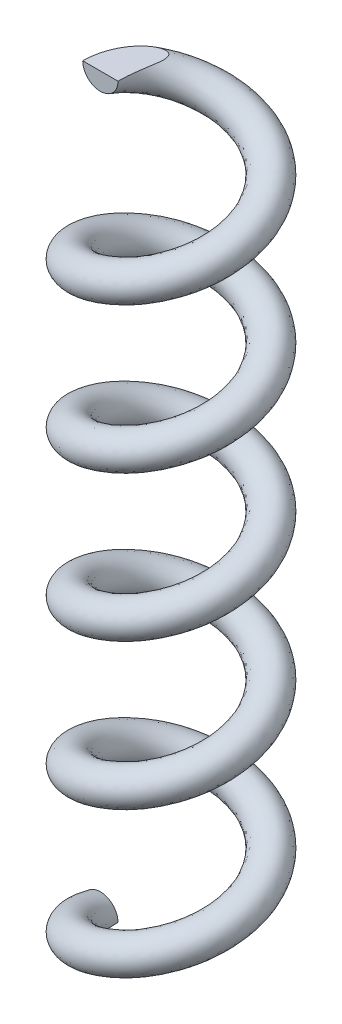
ISO-10303-21;
HEADER;
FILE_DESCRIPTION(('STEP AP214'),'2;1');
FILE_NAME('part.step','',(''),(''),'','','');
FILE_SCHEMA(('AUTOMOTIVE_DESIGN { 1 0 10303 214 1 1 1 1 }'));
ENDSEC;
DATA;
#1=APPLICATION_CONTEXT('core data for automotive mechanical design processes');
#2=APPLICATION_PROTOCOL_DEFINITION('international standard','automotive_design',2000,#1);
#3=PRODUCT_CONTEXT('',#1,'mechanical');
#4=PRODUCT('Part','Part','',(#3));
#5=PRODUCT_RELATED_PRODUCT_CATEGORY('part','',(#4));
#6=PRODUCT_DEFINITION_FORMATION('','',#4);
#7=PRODUCT_DEFINITION_CONTEXT('part definition',#1,'design');
#8=PRODUCT_DEFINITION('design','',#6,#7);
#9=PRODUCT_DEFINITION_SHAPE('','',#8);
#10=(LENGTH_UNIT() NAMED_UNIT(*) SI_UNIT(.MILLI.,.METRE.));
#11=(NAMED_UNIT(*) PLANE_ANGLE_UNIT() SI_UNIT($,.RADIAN.));
#12=(NAMED_UNIT(*) SI_UNIT($,.STERADIAN.) SOLID_ANGLE_UNIT());
#13=UNCERTAINTY_MEASURE_WITH_UNIT(LENGTH_MEASURE(1.E-05),#10,'distance_accuracy_value','');
#14=(GEOMETRIC_REPRESENTATION_CONTEXT(3) GLOBAL_UNCERTAINTY_ASSIGNED_CONTEXT((#13)) GLOBAL_UNIT_ASSIGNED_CONTEXT((#10,
#11,#12)) REPRESENTATION_CONTEXT('',''));
#15=CARTESIAN_POINT('',(0.,0.,0.));
#16=DIRECTION('',(0.,0.,1.));
#17=DIRECTION('',(1.,0.,0.));
#18=AXIS2_PLACEMENT_3D('',#15,#16,#17);
#19=CARTESIAN_POINT('',(-38.,72.8804031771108,9.77614774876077E-13));
#20=DIRECTION('',(0.,0.,1.));
#21=DIRECTION('',(1.,0.,0.));
#22=AXIS2_PLACEMENT_3D('',#19,#20,#21);
#23=PLANE('',#22);
#24=CARTESIAN_POINT('',(-38.,72.8804031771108,9.77614774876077E-13));
#25=DIRECTION('',(0.,0.,1.));
#26=DIRECTION('',(1.,0.,0.));
#27=AXIS2_PLACEMENT_3D('',#24,#25,#26);
#28=CIRCLE('',#27,3.5);
#29=CARTESIAN_POINT('',(-41.5,72.8804031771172,0.));
#30=VERTEX_POINT('',#29);
#31=CARTESIAN_POINT('',(-34.5,72.8804031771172,7.33211081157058E-13));
#32=VERTEX_POINT('',#31);
#33=EDGE_CURVE('E79',#30,#32,#28,.T.);
#34=ORIENTED_EDGE('',*,*,#33,.T.);
#35=DIRECTION('',(-1.,0.,0.));
#36=VECTOR('',#35,1.);
#37=CARTESIAN_POINT('',(-38.,72.8804031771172,9.77614774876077E-13));
#38=LINE('',#37,#36);
#39=EDGE_CURVE('E61',#32,#30,#38,.T.);
#40=ORIENTED_EDGE('',*,*,#39,.T.);
#41=EDGE_LOOP('',(#34,#40));
#42=FACE_BOUND('',#41,.T.);
#43=ADVANCED_FACE('F44',(#42),#23,.T.);
#44=CARTESIAN_POINT('',(-34.5,-71.5,0.));
#45=CARTESIAN_POINT('',(-34.5,-70.0561959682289,3.41165681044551));
#46=CARTESIAN_POINT('',(-32.4946784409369,-68.6123919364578,6.17174514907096));
#47=CARTESIAN_POINT('',(-30.4893568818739,-67.1685879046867,8.93183348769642));
#48=CARTESIAN_POINT('',(-27.2446784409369,-65.7247838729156,9.98609342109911));
#49=CARTESIAN_POINT('',(-24.,-64.2809798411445,11.0403533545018));
#50=CARTESIAN_POINT('',(-20.7553215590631,-62.8371758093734,9.98609342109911));
#51=CARTESIAN_POINT('',(-17.5106431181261,-61.3933717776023,8.93183348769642));
#52=CARTESIAN_POINT('',(-15.5053215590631,-59.9495677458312,6.17174514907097));
#53=CARTESIAN_POINT('',(-13.5,-58.5057637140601,3.41165681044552));
#54=CARTESIAN_POINT('',(-13.5,-57.0619596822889,0.));
#55=CARTESIAN_POINT('',(-13.5,-55.6181556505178,-3.41165681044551));
#56=CARTESIAN_POINT('',(-15.5053215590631,-54.1743516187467,-6.17174514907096));
#57=CARTESIAN_POINT('',(-17.5106431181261,-52.7305475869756,-8.93183348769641));
#58=CARTESIAN_POINT('',(-20.7553215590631,-51.2867435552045,-9.98609342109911));
#59=CARTESIAN_POINT('',(-24.,-49.8429395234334,-11.0403533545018));
#60=CARTESIAN_POINT('',(-27.2446784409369,-48.3991354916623,-9.98609342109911));
#61=CARTESIAN_POINT('',(-30.4893568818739,-46.9553314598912,-8.93183348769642));
#62=CARTESIAN_POINT('',(-32.4946784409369,-45.5115274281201,-6.17174514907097));
#63=CARTESIAN_POINT('',(-34.5,-44.067723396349,-3.41165681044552));
#64=CARTESIAN_POINT('',(-34.5,-42.6239193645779,0.));
#65=CARTESIAN_POINT('',(-34.5,-41.1801153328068,3.41165681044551));
#66=CARTESIAN_POINT('',(-32.4946784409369,-39.7363113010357,6.17174514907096));
#67=CARTESIAN_POINT('',(-30.4893568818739,-38.2925072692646,8.93183348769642));
#68=CARTESIAN_POINT('',(-27.2446784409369,-36.8487032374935,9.98609342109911));
#69=CARTESIAN_POINT('',(-24.,-35.4048992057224,11.0403533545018));
#70=CARTESIAN_POINT('',(-20.7553215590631,-33.9610951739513,9.98609342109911));
#71=CARTESIAN_POINT('',(-17.5106431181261,-32.5172911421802,8.93183348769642));
#72=CARTESIAN_POINT('',(-15.5053215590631,-31.0734871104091,6.17174514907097));
#73=CARTESIAN_POINT('',(-13.5,-29.629683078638,3.41165681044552));
#74=CARTESIAN_POINT('',(-13.5,-28.1858790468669,0.));
#75=CARTESIAN_POINT('',(-13.5,-26.7420750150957,-3.41165681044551));
#76=CARTESIAN_POINT('',(-15.5053215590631,-25.2982709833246,-6.17174514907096));
#77=CARTESIAN_POINT('',(-17.5106431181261,-23.8544669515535,-8.93183348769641));
#78=CARTESIAN_POINT('',(-20.7553215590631,-22.4106629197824,-9.98609342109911));
#79=CARTESIAN_POINT('',(-24.,-20.9668588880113,-11.0403533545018));
#80=CARTESIAN_POINT('',(-27.2446784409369,-19.5230548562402,-9.98609342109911));
#81=CARTESIAN_POINT('',(-30.4893568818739,-18.0792508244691,-8.93183348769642));
#82=CARTESIAN_POINT('',(-32.4946784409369,-16.635446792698,-6.17174514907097));
#83=CARTESIAN_POINT('',(-34.5,-15.1916427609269,-3.41165681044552));
#84=CARTESIAN_POINT('',(-34.5,-13.7478387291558,0.));
#85=CARTESIAN_POINT('',(-34.5,-12.3040346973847,3.41165681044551));
#86=CARTESIAN_POINT('',(-32.4946784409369,-10.8602306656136,6.17174514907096));
#87=CARTESIAN_POINT('',(-30.4893568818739,-9.41642663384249,8.93183348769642));
#88=CARTESIAN_POINT('',(-27.2446784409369,-7.97262260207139,9.98609342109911));
#89=CARTESIAN_POINT('',(-24.,-6.52881857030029,11.0403533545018));
#90=CARTESIAN_POINT('',(-20.7553215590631,-5.08501453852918,9.98609342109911));
#91=CARTESIAN_POINT('',(-17.5106431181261,-3.64121050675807,8.93183348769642));
#92=CARTESIAN_POINT('',(-15.5053215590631,-2.19740647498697,6.17174514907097));
#93=CARTESIAN_POINT('',(-13.5,-0.753602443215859,3.41165681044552));
#94=CARTESIAN_POINT('',(-13.5,0.690201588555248,0.));
#95=CARTESIAN_POINT('',(-13.5,2.13400562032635,-3.41165681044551));
#96=CARTESIAN_POINT('',(-15.5053215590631,3.57780965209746,-6.17174514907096));
#97=CARTESIAN_POINT('',(-17.5106431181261,5.02161368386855,-8.93183348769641));
#98=CARTESIAN_POINT('',(-20.7553215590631,6.46541771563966,-9.98609342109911));
#99=CARTESIAN_POINT('',(-24.,7.90922174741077,-11.0403533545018));
#100=CARTESIAN_POINT('',(-27.2446784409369,9.35302577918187,-9.98609342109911));
#101=CARTESIAN_POINT('',(-30.4893568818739,10.796829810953,-8.93183348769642));
#102=CARTESIAN_POINT('',(-32.4946784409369,12.2406338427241,-6.17174514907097));
#103=CARTESIAN_POINT('',(-34.5,13.6844378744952,-3.41165681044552));
#104=CARTESIAN_POINT('',(-34.5,15.1282419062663,0.));
#105=CARTESIAN_POINT('',(-34.5,16.5720459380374,3.41165681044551));
#106=CARTESIAN_POINT('',(-32.4946784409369,18.0158499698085,6.17174514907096));
#107=CARTESIAN_POINT('',(-30.4893568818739,19.4596540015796,8.93183348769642));
#108=CARTESIAN_POINT('',(-27.2446784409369,20.9034580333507,9.98609342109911));
#109=CARTESIAN_POINT('',(-24.,22.3472620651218,11.0403533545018));
#110=CARTESIAN_POINT('',(-20.7553215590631,23.7910660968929,9.98609342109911));
#111=CARTESIAN_POINT('',(-17.5106431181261,25.234870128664,8.93183348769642));
#112=CARTESIAN_POINT('',(-15.5053215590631,26.6786741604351,6.17174514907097));
#113=CARTESIAN_POINT('',(-13.5,28.1224781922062,3.41165681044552));
#114=CARTESIAN_POINT('',(-13.5,29.5662822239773,0.));
#115=CARTESIAN_POINT('',(-13.5,31.0100862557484,-3.41165681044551));
#116=CARTESIAN_POINT('',(-15.5053215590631,32.4538902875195,-6.17174514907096));
#117=CARTESIAN_POINT('',(-17.5106431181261,33.8976943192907,-8.93183348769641));
#118=CARTESIAN_POINT('',(-20.7553215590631,35.3414983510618,-9.98609342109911));
#119=CARTESIAN_POINT('',(-24.,36.7853023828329,-11.0403533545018));
#120=CARTESIAN_POINT('',(-27.2446784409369,38.229106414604,-9.98609342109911));
#121=CARTESIAN_POINT('',(-30.4893568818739,39.6729104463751,-8.93183348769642));
#122=CARTESIAN_POINT('',(-32.4946784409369,41.1167144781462,-6.17174514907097));
#123=CARTESIAN_POINT('',(-34.5,42.5605185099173,-3.41165681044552));
#124=CARTESIAN_POINT('',(-34.5,44.0043225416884,0.));
#125=CARTESIAN_POINT('',(-34.5,45.4481265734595,3.41165681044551));
#126=CARTESIAN_POINT('',(-32.4946784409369,46.8919306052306,6.17174514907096));
#127=CARTESIAN_POINT('',(-30.4893568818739,48.3357346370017,8.93183348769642));
#128=CARTESIAN_POINT('',(-27.2446784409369,49.7795386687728,9.98609342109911));
#129=CARTESIAN_POINT('',(-24.,51.2233427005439,11.0403533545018));
#130=CARTESIAN_POINT('',(-20.7553215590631,52.667146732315,9.98609342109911));
#131=CARTESIAN_POINT('',(-17.5106431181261,54.1109507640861,8.93183348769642));
#132=CARTESIAN_POINT('',(-15.5053215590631,55.5547547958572,6.17174514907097));
#133=CARTESIAN_POINT('',(-13.5,56.9985588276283,3.41165681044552));
#134=CARTESIAN_POINT('',(-13.5,58.4423628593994,0.));
#135=CARTESIAN_POINT('',(-13.5,59.8861668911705,-3.41165681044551));
#136=CARTESIAN_POINT('',(-15.5053215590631,61.3299709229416,-6.17174514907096));
#137=CARTESIAN_POINT('',(-17.5106431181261,62.7737749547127,-8.93183348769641));
#138=CARTESIAN_POINT('',(-20.7553215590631,64.2175789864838,-9.98609342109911));
#139=CARTESIAN_POINT('',(-24.,65.661383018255,-11.0403533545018));
#140=CARTESIAN_POINT('',(-27.2446784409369,67.1051870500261,-9.98609342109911));
#141=CARTESIAN_POINT('',(-30.4893568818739,68.5489910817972,-8.93183348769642));
#142=CARTESIAN_POINT('',(-32.4946784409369,69.9927951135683,-6.17174514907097));
#143=CARTESIAN_POINT('',(-34.5,71.4365991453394,-3.41165681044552));
#144=CARTESIAN_POINT('',(-34.5,72.8804031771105,0.));
#145=CARTESIAN_POINT('',(-34.5,-64.5,0.));
#146=CARTESIAN_POINT('',(-34.5,-63.0561959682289,3.41165681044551));
#147=CARTESIAN_POINT('',(-32.4946784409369,-61.6123919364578,6.17174514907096));
#148=CARTESIAN_POINT('',(-30.4893568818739,-60.1685879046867,8.93183348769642));
#149=CARTESIAN_POINT('',(-27.2446784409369,-58.7247838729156,9.98609342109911));
#150=CARTESIAN_POINT('',(-24.,-57.2809798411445,11.0403533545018));
#151=CARTESIAN_POINT('',(-20.7553215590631,-55.8371758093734,9.98609342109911));
#152=CARTESIAN_POINT('',(-17.5106431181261,-54.3933717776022,8.93183348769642));
#153=CARTESIAN_POINT('',(-15.5053215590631,-52.9495677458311,6.17174514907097));
#154=CARTESIAN_POINT('',(-13.5,-51.50576371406,3.41165681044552));
#155=CARTESIAN_POINT('',(-13.5,-50.0619596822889,0.));
#156=CARTESIAN_POINT('',(-13.5,-48.6181556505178,-3.41165681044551));
#157=CARTESIAN_POINT('',(-15.5053215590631,-47.1743516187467,-6.17174514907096));
#158=CARTESIAN_POINT('',(-17.5106431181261,-45.7305475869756,-8.93183348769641));
#159=CARTESIAN_POINT('',(-20.7553215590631,-44.2867435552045,-9.98609342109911));
#160=CARTESIAN_POINT('',(-24.,-42.8429395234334,-11.0403533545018));
#161=CARTESIAN_POINT('',(-27.2446784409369,-41.3991354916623,-9.98609342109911));
#162=CARTESIAN_POINT('',(-30.4893568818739,-39.9553314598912,-8.93183348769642));
#163=CARTESIAN_POINT('',(-32.4946784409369,-38.5115274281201,-6.17174514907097));
#164=CARTESIAN_POINT('',(-34.5,-37.067723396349,-3.41165681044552));
#165=CARTESIAN_POINT('',(-34.5,-35.6239193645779,0.));
#166=CARTESIAN_POINT('',(-34.5,-34.1801153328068,3.41165681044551));
#167=CARTESIAN_POINT('',(-32.4946784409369,-32.7363113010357,6.17174514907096));
#168=CARTESIAN_POINT('',(-30.4893568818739,-31.2925072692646,8.93183348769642));
#169=CARTESIAN_POINT('',(-27.2446784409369,-29.8487032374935,9.98609342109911));
#170=CARTESIAN_POINT('',(-24.,-28.4048992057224,11.0403533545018));
#171=CARTESIAN_POINT('',(-20.7553215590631,-26.9610951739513,9.98609342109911));
#172=CARTESIAN_POINT('',(-17.5106431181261,-25.5172911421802,8.93183348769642));
#173=CARTESIAN_POINT('',(-15.5053215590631,-24.0734871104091,6.17174514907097));
#174=CARTESIAN_POINT('',(-13.5,-22.6296830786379,3.41165681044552));
#175=CARTESIAN_POINT('',(-13.5,-21.1858790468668,0.));
#176=CARTESIAN_POINT('',(-13.5,-19.7420750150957,-3.41165681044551));
#177=CARTESIAN_POINT('',(-15.5053215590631,-18.2982709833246,-6.17174514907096));
#178=CARTESIAN_POINT('',(-17.5106431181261,-16.8544669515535,-8.93183348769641));
#179=CARTESIAN_POINT('',(-20.7553215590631,-15.4106629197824,-9.98609342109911));
#180=CARTESIAN_POINT('',(-24.,-13.9668588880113,-11.0403533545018));
#181=CARTESIAN_POINT('',(-27.2446784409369,-12.5230548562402,-9.98609342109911));
#182=CARTESIAN_POINT('',(-30.4893568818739,-11.0792508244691,-8.93183348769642));
#183=CARTESIAN_POINT('',(-32.4946784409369,-9.63544679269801,-6.17174514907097));
#184=CARTESIAN_POINT('',(-34.5,-8.1916427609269,-3.41165681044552));
#185=CARTESIAN_POINT('',(-34.5,-6.7478387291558,0.));
#186=CARTESIAN_POINT('',(-34.5,-5.30403469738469,3.41165681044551));
#187=CARTESIAN_POINT('',(-32.4946784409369,-3.86023066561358,6.17174514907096));
#188=CARTESIAN_POINT('',(-30.4893568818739,-2.41642663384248,8.93183348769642));
#189=CARTESIAN_POINT('',(-27.2446784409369,-0.972622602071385,9.98609342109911));
#190=CARTESIAN_POINT('',(-24.,0.471181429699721,11.0403533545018));
#191=CARTESIAN_POINT('',(-20.7553215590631,1.91498546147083,9.98609342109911));
#192=CARTESIAN_POINT('',(-17.5106431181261,3.35878949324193,8.93183348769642));
#193=CARTESIAN_POINT('',(-15.5053215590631,4.80259352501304,6.17174514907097));
#194=CARTESIAN_POINT('',(-13.5,6.24639755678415,3.41165681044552));
#195=CARTESIAN_POINT('',(-13.5,7.69020158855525,0.));
#196=CARTESIAN_POINT('',(-13.5,9.13400562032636,-3.41165681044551));
#197=CARTESIAN_POINT('',(-15.5053215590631,10.5778096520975,-6.17174514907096));
#198=CARTESIAN_POINT('',(-17.5106431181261,12.0216136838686,-8.93183348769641));
#199=CARTESIAN_POINT('',(-20.7553215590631,13.4654177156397,-9.98609342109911));
#200=CARTESIAN_POINT('',(-24.,14.9092217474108,-11.0403533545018));
#201=CARTESIAN_POINT('',(-27.2446784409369,16.3530257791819,-9.98609342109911));
#202=CARTESIAN_POINT('',(-30.4893568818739,17.796829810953,-8.93183348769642));
#203=CARTESIAN_POINT('',(-32.4946784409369,19.2406338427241,-6.17174514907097));
#204=CARTESIAN_POINT('',(-34.5,20.6844378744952,-3.41165681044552));
#205=CARTESIAN_POINT('',(-34.5,22.1282419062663,0.));
#206=CARTESIAN_POINT('',(-34.5,23.5720459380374,3.41165681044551));
#207=CARTESIAN_POINT('',(-32.4946784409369,25.0158499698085,6.17174514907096));
#208=CARTESIAN_POINT('',(-30.4893568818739,26.4596540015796,8.93183348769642));
#209=CARTESIAN_POINT('',(-27.2446784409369,27.9034580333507,9.98609342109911));
#210=CARTESIAN_POINT('',(-24.,29.3472620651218,11.0403533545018));
#211=CARTESIAN_POINT('',(-20.7553215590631,30.7910660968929,9.98609342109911));
#212=CARTESIAN_POINT('',(-17.5106431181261,32.234870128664,8.93183348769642));
#213=CARTESIAN_POINT('',(-15.5053215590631,33.6786741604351,6.17174514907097));
#214=CARTESIAN_POINT('',(-13.5,35.1224781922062,3.41165681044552));
#215=CARTESIAN_POINT('',(-13.5,36.5662822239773,0.));
#216=CARTESIAN_POINT('',(-13.5,38.0100862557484,-3.41165681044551));
#217=CARTESIAN_POINT('',(-15.5053215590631,39.4538902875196,-6.17174514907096));
#218=CARTESIAN_POINT('',(-17.5106431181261,40.8976943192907,-8.93183348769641));
#219=CARTESIAN_POINT('',(-20.7553215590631,42.3414983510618,-9.98609342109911));
#220=CARTESIAN_POINT('',(-24.,43.7853023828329,-11.0403533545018));
#221=CARTESIAN_POINT('',(-27.2446784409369,45.229106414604,-9.98609342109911));
#222=CARTESIAN_POINT('',(-30.4893568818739,46.6729104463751,-8.93183348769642));
#223=CARTESIAN_POINT('',(-32.4946784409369,48.1167144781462,-6.17174514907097));
#224=CARTESIAN_POINT('',(-34.5,49.5605185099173,-3.41165681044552));
#225=CARTESIAN_POINT('',(-34.5,51.0043225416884,0.));
#226=CARTESIAN_POINT('',(-34.5,52.4481265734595,3.41165681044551));
#227=CARTESIAN_POINT('',(-32.4946784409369,53.8919306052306,6.17174514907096));
#228=CARTESIAN_POINT('',(-30.4893568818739,55.3357346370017,8.93183348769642));
#229=CARTESIAN_POINT('',(-27.2446784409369,56.7795386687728,9.98609342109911));
#230=CARTESIAN_POINT('',(-24.,58.2233427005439,11.0403533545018));
#231=CARTESIAN_POINT('',(-20.7553215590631,59.667146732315,9.98609342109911));
#232=CARTESIAN_POINT('',(-17.5106431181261,61.1109507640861,8.93183348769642));
#233=CARTESIAN_POINT('',(-15.5053215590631,62.5547547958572,6.17174514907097));
#234=CARTESIAN_POINT('',(-13.5,63.9985588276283,3.41165681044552));
#235=CARTESIAN_POINT('',(-13.5,65.4423628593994,0.));
#236=CARTESIAN_POINT('',(-13.5,66.8861668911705,-3.41165681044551));
#237=CARTESIAN_POINT('',(-15.5053215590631,68.3299709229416,-6.17174514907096));
#238=CARTESIAN_POINT('',(-17.5106431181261,69.7737749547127,-8.93183348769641));
#239=CARTESIAN_POINT('',(-20.7553215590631,71.2175789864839,-9.98609342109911));
#240=CARTESIAN_POINT('',(-24.,72.661383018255,-11.0403533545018));
#241=CARTESIAN_POINT('',(-27.2446784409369,74.1051870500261,-9.98609342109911));
#242=CARTESIAN_POINT('',(-30.4893568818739,75.5489910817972,-8.93183348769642));
#243=CARTESIAN_POINT('',(-32.4946784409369,76.9927951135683,-6.17174514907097));
#244=CARTESIAN_POINT('',(-34.5,78.4365991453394,-3.41165681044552));
#245=CARTESIAN_POINT('',(-34.5,79.8804031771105,0.));
#246=CARTESIAN_POINT('',(-41.5,-64.5,0.));
#247=CARTESIAN_POINT('',(-41.5,-63.0561959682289,5.68609468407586));
#248=CARTESIAN_POINT('',(-38.1577974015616,-61.6123919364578,10.2862419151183));
#249=CARTESIAN_POINT('',(-34.8155948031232,-60.1685879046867,14.8863891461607));
#250=CARTESIAN_POINT('',(-29.4077974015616,-58.7247838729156,16.6434890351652));
#251=CARTESIAN_POINT('',(-24.,-57.2809798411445,18.4005889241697));
#252=CARTESIAN_POINT('',(-18.5922025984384,-55.8371758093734,16.6434890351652));
#253=CARTESIAN_POINT('',(-13.1844051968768,-54.3933717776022,14.8863891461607));
#254=CARTESIAN_POINT('',(-9.84220259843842,-52.9495677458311,10.2862419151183));
#255=CARTESIAN_POINT('',(-6.5,-51.50576371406,5.68609468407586));
#256=CARTESIAN_POINT('',(-6.5,-50.0619596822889,0.));
#257=CARTESIAN_POINT('',(-6.5,-48.6181556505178,-5.68609468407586));
#258=CARTESIAN_POINT('',(-9.84220259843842,-47.1743516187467,-10.2862419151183));
#259=CARTESIAN_POINT('',(-13.1844051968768,-45.7305475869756,-14.8863891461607));
#260=CARTESIAN_POINT('',(-18.5922025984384,-44.2867435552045,-16.6434890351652));
#261=CARTESIAN_POINT('',(-24.,-42.8429395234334,-18.4005889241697));
#262=CARTESIAN_POINT('',(-29.4077974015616,-41.3991354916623,-16.6434890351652));
#263=CARTESIAN_POINT('',(-34.8155948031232,-39.9553314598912,-14.8863891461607));
#264=CARTESIAN_POINT('',(-38.1577974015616,-38.5115274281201,-10.2862419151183));
#265=CARTESIAN_POINT('',(-41.5,-37.067723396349,-5.68609468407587));
#266=CARTESIAN_POINT('',(-41.5,-35.6239193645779,0.));
#267=CARTESIAN_POINT('',(-41.5,-34.1801153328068,5.68609468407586));
#268=CARTESIAN_POINT('',(-38.1577974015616,-32.7363113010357,10.2862419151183));
#269=CARTESIAN_POINT('',(-34.8155948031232,-31.2925072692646,14.8863891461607));
#270=CARTESIAN_POINT('',(-29.4077974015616,-29.8487032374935,16.6434890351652));
#271=CARTESIAN_POINT('',(-24.,-28.4048992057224,18.4005889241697));
#272=CARTESIAN_POINT('',(-18.5922025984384,-26.9610951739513,16.6434890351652));
#273=CARTESIAN_POINT('',(-13.1844051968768,-25.5172911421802,14.8863891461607));
#274=CARTESIAN_POINT('',(-9.84220259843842,-24.0734871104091,10.2862419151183));
#275=CARTESIAN_POINT('',(-6.5,-22.6296830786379,5.68609468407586));
#276=CARTESIAN_POINT('',(-6.5,-21.1858790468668,0.));
#277=CARTESIAN_POINT('',(-6.5,-19.7420750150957,-5.68609468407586));
#278=CARTESIAN_POINT('',(-9.84220259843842,-18.2982709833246,-10.2862419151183));
#279=CARTESIAN_POINT('',(-13.1844051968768,-16.8544669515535,-14.8863891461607));
#280=CARTESIAN_POINT('',(-18.5922025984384,-15.4106629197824,-16.6434890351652));
#281=CARTESIAN_POINT('',(-24.,-13.9668588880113,-18.4005889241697));
#282=CARTESIAN_POINT('',(-29.4077974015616,-12.5230548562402,-16.6434890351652));
#283=CARTESIAN_POINT('',(-34.8155948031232,-11.0792508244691,-14.8863891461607));
#284=CARTESIAN_POINT('',(-38.1577974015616,-9.63544679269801,-10.2862419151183));
#285=CARTESIAN_POINT('',(-41.5,-8.1916427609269,-5.68609468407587));
#286=CARTESIAN_POINT('',(-41.5,-6.7478387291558,0.));
#287=CARTESIAN_POINT('',(-41.5,-5.30403469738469,5.68609468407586));
#288=CARTESIAN_POINT('',(-38.1577974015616,-3.86023066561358,10.2862419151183));
#289=CARTESIAN_POINT('',(-34.8155948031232,-2.41642663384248,14.8863891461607));
#290=CARTESIAN_POINT('',(-29.4077974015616,-0.972622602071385,16.6434890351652));
#291=CARTESIAN_POINT('',(-24.,0.471181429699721,18.4005889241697));
#292=CARTESIAN_POINT('',(-18.5922025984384,1.91498546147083,16.6434890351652));
#293=CARTESIAN_POINT('',(-13.1844051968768,3.35878949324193,14.8863891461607));
#294=CARTESIAN_POINT('',(-9.84220259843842,4.80259352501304,10.2862419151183));
#295=CARTESIAN_POINT('',(-6.5,6.24639755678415,5.68609468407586));
#296=CARTESIAN_POINT('',(-6.5,7.69020158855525,0.));
#297=CARTESIAN_POINT('',(-6.5,9.13400562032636,-5.68609468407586));
#298=CARTESIAN_POINT('',(-9.84220259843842,10.5778096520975,-10.2862419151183));
#299=CARTESIAN_POINT('',(-13.1844051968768,12.0216136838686,-14.8863891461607));
#300=CARTESIAN_POINT('',(-18.5922025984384,13.4654177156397,-16.6434890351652));
#301=CARTESIAN_POINT('',(-24.,14.9092217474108,-18.4005889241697));
#302=CARTESIAN_POINT('',(-29.4077974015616,16.3530257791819,-16.6434890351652));
#303=CARTESIAN_POINT('',(-34.8155948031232,17.796829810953,-14.8863891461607));
#304=CARTESIAN_POINT('',(-38.1577974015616,19.2406338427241,-10.2862419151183));
#305=CARTESIAN_POINT('',(-41.5,20.6844378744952,-5.68609468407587));
#306=CARTESIAN_POINT('',(-41.5,22.1282419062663,0.));
#307=CARTESIAN_POINT('',(-41.5,23.5720459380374,5.68609468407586));
#308=CARTESIAN_POINT('',(-38.1577974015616,25.0158499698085,10.2862419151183));
#309=CARTESIAN_POINT('',(-34.8155948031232,26.4596540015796,14.8863891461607));
#310=CARTESIAN_POINT('',(-29.4077974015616,27.9034580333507,16.6434890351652));
#311=CARTESIAN_POINT('',(-24.,29.3472620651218,18.4005889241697));
#312=CARTESIAN_POINT('',(-18.5922025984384,30.7910660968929,16.6434890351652));
#313=CARTESIAN_POINT('',(-13.1844051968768,32.234870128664,14.8863891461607));
#314=CARTESIAN_POINT('',(-9.84220259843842,33.6786741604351,10.2862419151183));
#315=CARTESIAN_POINT('',(-6.5,35.1224781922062,5.68609468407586));
#316=CARTESIAN_POINT('',(-6.5,36.5662822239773,0.));
#317=CARTESIAN_POINT('',(-6.5,38.0100862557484,-5.68609468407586));
#318=CARTESIAN_POINT('',(-9.84220259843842,39.4538902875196,-10.2862419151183));
#319=CARTESIAN_POINT('',(-13.1844051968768,40.8976943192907,-14.8863891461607));
#320=CARTESIAN_POINT('',(-18.5922025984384,42.3414983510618,-16.6434890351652));
#321=CARTESIAN_POINT('',(-24.,43.7853023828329,-18.4005889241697));
#322=CARTESIAN_POINT('',(-29.4077974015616,45.229106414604,-16.6434890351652));
#323=CARTESIAN_POINT('',(-34.8155948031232,46.6729104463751,-14.8863891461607));
#324=CARTESIAN_POINT('',(-38.1577974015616,48.1167144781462,-10.2862419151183));
#325=CARTESIAN_POINT('',(-41.5,49.5605185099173,-5.68609468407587));
#326=CARTESIAN_POINT('',(-41.5,51.0043225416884,0.));
#327=CARTESIAN_POINT('',(-41.5,52.4481265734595,5.68609468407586));
#328=CARTESIAN_POINT('',(-38.1577974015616,53.8919306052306,10.2862419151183));
#329=CARTESIAN_POINT('',(-34.8155948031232,55.3357346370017,14.8863891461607));
#330=CARTESIAN_POINT('',(-29.4077974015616,56.7795386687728,16.6434890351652));
#331=CARTESIAN_POINT('',(-24.,58.2233427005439,18.4005889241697));
#332=CARTESIAN_POINT('',(-18.5922025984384,59.667146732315,16.6434890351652));
#333=CARTESIAN_POINT('',(-13.1844051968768,61.1109507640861,14.8863891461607));
#334=CARTESIAN_POINT('',(-9.84220259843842,62.5547547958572,10.2862419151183));
#335=CARTESIAN_POINT('',(-6.5,63.9985588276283,5.68609468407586));
#336=CARTESIAN_POINT('',(-6.5,65.4423628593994,0.));
#337=CARTESIAN_POINT('',(-6.5,66.8861668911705,-5.68609468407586));
#338=CARTESIAN_POINT('',(-9.84220259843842,68.3299709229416,-10.2862419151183));
#339=CARTESIAN_POINT('',(-13.1844051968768,69.7737749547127,-14.8863891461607));
#340=CARTESIAN_POINT('',(-18.5922025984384,71.2175789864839,-16.6434890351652));
#341=CARTESIAN_POINT('',(-24.,72.661383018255,-18.4005889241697));
#342=CARTESIAN_POINT('',(-29.4077974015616,74.1051870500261,-16.6434890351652));
#343=CARTESIAN_POINT('',(-34.8155948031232,75.5489910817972,-14.8863891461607));
#344=CARTESIAN_POINT('',(-38.1577974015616,76.9927951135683,-10.2862419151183));
#345=CARTESIAN_POINT('',(-41.5,78.4365991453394,-5.68609468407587));
#346=CARTESIAN_POINT('',(-41.5,79.8804031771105,0.));
#347=CARTESIAN_POINT('',(-41.5,-71.5,0.));
#348=CARTESIAN_POINT('',(-41.5,-70.0561959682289,5.68609468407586));
#349=CARTESIAN_POINT('',(-38.1577974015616,-68.6123919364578,10.2862419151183));
#350=CARTESIAN_POINT('',(-34.8155948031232,-67.1685879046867,14.8863891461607));
#351=CARTESIAN_POINT('',(-29.4077974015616,-65.7247838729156,16.6434890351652));
#352=CARTESIAN_POINT('',(-24.,-64.2809798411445,18.4005889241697));
#353=CARTESIAN_POINT('',(-18.5922025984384,-62.8371758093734,16.6434890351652));
#354=CARTESIAN_POINT('',(-13.1844051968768,-61.3933717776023,14.8863891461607));
#355=CARTESIAN_POINT('',(-9.84220259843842,-59.9495677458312,10.2862419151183));
#356=CARTESIAN_POINT('',(-6.5,-58.5057637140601,5.68609468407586));
#357=CARTESIAN_POINT('',(-6.5,-57.0619596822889,0.));
#358=CARTESIAN_POINT('',(-6.5,-55.6181556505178,-5.68609468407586));
#359=CARTESIAN_POINT('',(-9.84220259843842,-54.1743516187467,-10.2862419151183));
#360=CARTESIAN_POINT('',(-13.1844051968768,-52.7305475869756,-14.8863891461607));
#361=CARTESIAN_POINT('',(-18.5922025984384,-51.2867435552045,-16.6434890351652));
#362=CARTESIAN_POINT('',(-24.,-49.8429395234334,-18.4005889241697));
#363=CARTESIAN_POINT('',(-29.4077974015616,-48.3991354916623,-16.6434890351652));
#364=CARTESIAN_POINT('',(-34.8155948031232,-46.9553314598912,-14.8863891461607));
#365=CARTESIAN_POINT('',(-38.1577974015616,-45.5115274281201,-10.2862419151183));
#366=CARTESIAN_POINT('',(-41.5,-44.067723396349,-5.68609468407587));
#367=CARTESIAN_POINT('',(-41.5,-42.6239193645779,0.));
#368=CARTESIAN_POINT('',(-41.5,-41.1801153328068,5.68609468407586));
#369=CARTESIAN_POINT('',(-38.1577974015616,-39.7363113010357,10.2862419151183));
#370=CARTESIAN_POINT('',(-34.8155948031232,-38.2925072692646,14.8863891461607));
#371=CARTESIAN_POINT('',(-29.4077974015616,-36.8487032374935,16.6434890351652));
#372=CARTESIAN_POINT('',(-24.,-35.4048992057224,18.4005889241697));
#373=CARTESIAN_POINT('',(-18.5922025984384,-33.9610951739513,16.6434890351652));
#374=CARTESIAN_POINT('',(-13.1844051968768,-32.5172911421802,14.8863891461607));
#375=CARTESIAN_POINT('',(-9.84220259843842,-31.0734871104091,10.2862419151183));
#376=CARTESIAN_POINT('',(-6.5,-29.629683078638,5.68609468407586));
#377=CARTESIAN_POINT('',(-6.5,-28.1858790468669,0.));
#378=CARTESIAN_POINT('',(-6.5,-26.7420750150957,-5.68609468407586));
#379=CARTESIAN_POINT('',(-9.84220259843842,-25.2982709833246,-10.2862419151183));
#380=CARTESIAN_POINT('',(-13.1844051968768,-23.8544669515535,-14.8863891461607));
#381=CARTESIAN_POINT('',(-18.5922025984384,-22.4106629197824,-16.6434890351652));
#382=CARTESIAN_POINT('',(-24.,-20.9668588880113,-18.4005889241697));
#383=CARTESIAN_POINT('',(-29.4077974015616,-19.5230548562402,-16.6434890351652));
#384=CARTESIAN_POINT('',(-34.8155948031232,-18.0792508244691,-14.8863891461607));
#385=CARTESIAN_POINT('',(-38.1577974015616,-16.635446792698,-10.2862419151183));
#386=CARTESIAN_POINT('',(-41.5,-15.1916427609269,-5.68609468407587));
#387=CARTESIAN_POINT('',(-41.5,-13.7478387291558,0.));
#388=CARTESIAN_POINT('',(-41.5,-12.3040346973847,5.68609468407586));
#389=CARTESIAN_POINT('',(-38.1577974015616,-10.8602306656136,10.2862419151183));
#390=CARTESIAN_POINT('',(-34.8155948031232,-9.41642663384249,14.8863891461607));
#391=CARTESIAN_POINT('',(-29.4077974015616,-7.97262260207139,16.6434890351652));
#392=CARTESIAN_POINT('',(-24.,-6.52881857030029,18.4005889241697));
#393=CARTESIAN_POINT('',(-18.5922025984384,-5.08501453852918,16.6434890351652));
#394=CARTESIAN_POINT('',(-13.1844051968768,-3.64121050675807,14.8863891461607));
#395=CARTESIAN_POINT('',(-9.84220259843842,-2.19740647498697,10.2862419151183));
#396=CARTESIAN_POINT('',(-6.5,-0.753602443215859,5.68609468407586));
#397=CARTESIAN_POINT('',(-6.5,0.690201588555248,0.));
#398=CARTESIAN_POINT('',(-6.5,2.13400562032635,-5.68609468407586));
#399=CARTESIAN_POINT('',(-9.84220259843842,3.57780965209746,-10.2862419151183));
#400=CARTESIAN_POINT('',(-13.1844051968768,5.02161368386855,-14.8863891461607));
#401=CARTESIAN_POINT('',(-18.5922025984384,6.46541771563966,-16.6434890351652));
#402=CARTESIAN_POINT('',(-24.,7.90922174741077,-18.4005889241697));
#403=CARTESIAN_POINT('',(-29.4077974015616,9.35302577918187,-16.6434890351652));
#404=CARTESIAN_POINT('',(-34.8155948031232,10.796829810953,-14.8863891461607));
#405=CARTESIAN_POINT('',(-38.1577974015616,12.2406338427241,-10.2862419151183));
#406=CARTESIAN_POINT('',(-41.5,13.6844378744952,-5.68609468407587));
#407=CARTESIAN_POINT('',(-41.5,15.1282419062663,0.));
#408=CARTESIAN_POINT('',(-41.5,16.5720459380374,5.68609468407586));
#409=CARTESIAN_POINT('',(-38.1577974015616,18.0158499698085,10.2862419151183));
#410=CARTESIAN_POINT('',(-34.8155948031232,19.4596540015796,14.8863891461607));
#411=CARTESIAN_POINT('',(-29.4077974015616,20.9034580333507,16.6434890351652));
#412=CARTESIAN_POINT('',(-24.,22.3472620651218,18.4005889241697));
#413=CARTESIAN_POINT('',(-18.5922025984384,23.7910660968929,16.6434890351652));
#414=CARTESIAN_POINT('',(-13.1844051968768,25.234870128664,14.8863891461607));
#415=CARTESIAN_POINT('',(-9.84220259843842,26.6786741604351,10.2862419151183));
#416=CARTESIAN_POINT('',(-6.5,28.1224781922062,5.68609468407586));
#417=CARTESIAN_POINT('',(-6.5,29.5662822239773,0.));
#418=CARTESIAN_POINT('',(-6.5,31.0100862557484,-5.68609468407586));
#419=CARTESIAN_POINT('',(-9.84220259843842,32.4538902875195,-10.2862419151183));
#420=CARTESIAN_POINT('',(-13.1844051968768,33.8976943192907,-14.8863891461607));
#421=CARTESIAN_POINT('',(-18.5922025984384,35.3414983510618,-16.6434890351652));
#422=CARTESIAN_POINT('',(-24.,36.7853023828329,-18.4005889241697));
#423=CARTESIAN_POINT('',(-29.4077974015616,38.229106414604,-16.6434890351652));
#424=CARTESIAN_POINT('',(-34.8155948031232,39.6729104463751,-14.8863891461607));
#425=CARTESIAN_POINT('',(-38.1577974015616,41.1167144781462,-10.2862419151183));
#426=CARTESIAN_POINT('',(-41.5,42.5605185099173,-5.68609468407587));
#427=CARTESIAN_POINT('',(-41.5,44.0043225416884,0.));
#428=CARTESIAN_POINT('',(-41.5,45.4481265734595,5.68609468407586));
#429=CARTESIAN_POINT('',(-38.1577974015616,46.8919306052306,10.2862419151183));
#430=CARTESIAN_POINT('',(-34.8155948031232,48.3357346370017,14.8863891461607));
#431=CARTESIAN_POINT('',(-29.4077974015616,49.7795386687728,16.6434890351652));
#432=CARTESIAN_POINT('',(-24.,51.2233427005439,18.4005889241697));
#433=CARTESIAN_POINT('',(-18.5922025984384,52.667146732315,16.6434890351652));
#434=CARTESIAN_POINT('',(-13.1844051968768,54.1109507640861,14.8863891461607));
#435=CARTESIAN_POINT('',(-9.84220259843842,55.5547547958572,10.2862419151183));
#436=CARTESIAN_POINT('',(-6.5,56.9985588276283,5.68609468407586));
#437=CARTESIAN_POINT('',(-6.5,58.4423628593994,0.));
#438=CARTESIAN_POINT('',(-6.5,59.8861668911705,-5.68609468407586));
#439=CARTESIAN_POINT('',(-9.84220259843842,61.3299709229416,-10.2862419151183));
#440=CARTESIAN_POINT('',(-13.1844051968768,62.7737749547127,-14.8863891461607));
#441=CARTESIAN_POINT('',(-18.5922025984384,64.2175789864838,-16.6434890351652));
#442=CARTESIAN_POINT('',(-24.,65.661383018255,-18.4005889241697));
#443=CARTESIAN_POINT('',(-29.4077974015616,67.1051870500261,-16.6434890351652));
#444=CARTESIAN_POINT('',(-34.8155948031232,68.5489910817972,-14.8863891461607));
#445=CARTESIAN_POINT('',(-38.1577974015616,69.9927951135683,-10.2862419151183));
#446=CARTESIAN_POINT('',(-41.5,71.4365991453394,-5.68609468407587));
#447=CARTESIAN_POINT('',(-41.5,72.8804031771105,0.));
#448=CARTESIAN_POINT('',(-41.5,-78.5,0.));
#449=CARTESIAN_POINT('',(-41.5,-77.0561959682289,5.68609468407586));
#450=CARTESIAN_POINT('',(-38.1577974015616,-75.6123919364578,10.2862419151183));
#451=CARTESIAN_POINT('',(-34.8155948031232,-74.1685879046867,14.8863891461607));
#452=CARTESIAN_POINT('',(-29.4077974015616,-72.7247838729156,16.6434890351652));
#453=CARTESIAN_POINT('',(-24.,-71.2809798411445,18.4005889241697));
#454=CARTESIAN_POINT('',(-18.5922025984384,-69.8371758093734,16.6434890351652));
#455=CARTESIAN_POINT('',(-13.1844051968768,-68.3933717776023,14.8863891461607));
#456=CARTESIAN_POINT('',(-9.84220259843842,-66.9495677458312,10.2862419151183));
#457=CARTESIAN_POINT('',(-6.5,-65.5057637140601,5.68609468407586));
#458=CARTESIAN_POINT('',(-6.5,-64.0619596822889,0.));
#459=CARTESIAN_POINT('',(-6.5,-62.6181556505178,-5.68609468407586));
#460=CARTESIAN_POINT('',(-9.84220259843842,-61.1743516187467,-10.2862419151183));
#461=CARTESIAN_POINT('',(-13.1844051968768,-59.7305475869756,-14.8863891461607));
#462=CARTESIAN_POINT('',(-18.5922025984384,-58.2867435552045,-16.6434890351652));
#463=CARTESIAN_POINT('',(-24.,-56.8429395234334,-18.4005889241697));
#464=CARTESIAN_POINT('',(-29.4077974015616,-55.3991354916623,-16.6434890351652));
#465=CARTESIAN_POINT('',(-34.8155948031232,-53.9553314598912,-14.8863891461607));
#466=CARTESIAN_POINT('',(-38.1577974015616,-52.5115274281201,-10.2862419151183));
#467=CARTESIAN_POINT('',(-41.5,-51.067723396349,-5.68609468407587));
#468=CARTESIAN_POINT('',(-41.5,-49.6239193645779,0.));
#469=CARTESIAN_POINT('',(-41.5,-48.1801153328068,5.68609468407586));
#470=CARTESIAN_POINT('',(-38.1577974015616,-46.7363113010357,10.2862419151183));
#471=CARTESIAN_POINT('',(-34.8155948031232,-45.2925072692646,14.8863891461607));
#472=CARTESIAN_POINT('',(-29.4077974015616,-43.8487032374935,16.6434890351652));
#473=CARTESIAN_POINT('',(-24.,-42.4048992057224,18.4005889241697));
#474=CARTESIAN_POINT('',(-18.5922025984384,-40.9610951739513,16.6434890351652));
#475=CARTESIAN_POINT('',(-13.1844051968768,-39.5172911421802,14.8863891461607));
#476=CARTESIAN_POINT('',(-9.84220259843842,-38.0734871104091,10.2862419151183));
#477=CARTESIAN_POINT('',(-6.5,-36.629683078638,5.68609468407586));
#478=CARTESIAN_POINT('',(-6.5,-35.1858790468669,0.));
#479=CARTESIAN_POINT('',(-6.5,-33.7420750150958,-5.68609468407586));
#480=CARTESIAN_POINT('',(-9.84220259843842,-32.2982709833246,-10.2862419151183));
#481=CARTESIAN_POINT('',(-13.1844051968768,-30.8544669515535,-14.8863891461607));
#482=CARTESIAN_POINT('',(-18.5922025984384,-29.4106629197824,-16.6434890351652));
#483=CARTESIAN_POINT('',(-24.,-27.9668588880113,-18.4005889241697));
#484=CARTESIAN_POINT('',(-29.4077974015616,-26.5230548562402,-16.6434890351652));
#485=CARTESIAN_POINT('',(-34.8155948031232,-25.0792508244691,-14.8863891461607));
#486=CARTESIAN_POINT('',(-38.1577974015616,-23.635446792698,-10.2862419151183));
#487=CARTESIAN_POINT('',(-41.5,-22.1916427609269,-5.68609468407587));
#488=CARTESIAN_POINT('',(-41.5,-20.7478387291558,0.));
#489=CARTESIAN_POINT('',(-41.5,-19.3040346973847,5.68609468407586));
#490=CARTESIAN_POINT('',(-38.1577974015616,-17.8602306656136,10.2862419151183));
#491=CARTESIAN_POINT('',(-34.8155948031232,-16.4164266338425,14.8863891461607));
#492=CARTESIAN_POINT('',(-29.4077974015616,-14.9726226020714,16.6434890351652));
#493=CARTESIAN_POINT('',(-24.,-13.5288185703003,18.4005889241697));
#494=CARTESIAN_POINT('',(-18.5922025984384,-12.0850145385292,16.6434890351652));
#495=CARTESIAN_POINT('',(-13.1844051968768,-10.6412105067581,14.8863891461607));
#496=CARTESIAN_POINT('',(-9.84220259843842,-9.19740647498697,10.2862419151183));
#497=CARTESIAN_POINT('',(-6.5,-7.75360244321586,5.68609468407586));
#498=CARTESIAN_POINT('',(-6.5,-6.30979841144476,0.));
#499=CARTESIAN_POINT('',(-6.5,-4.86599437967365,-5.68609468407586));
#500=CARTESIAN_POINT('',(-9.84220259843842,-3.42219034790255,-10.2862419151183));
#501=CARTESIAN_POINT('',(-13.1844051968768,-1.97838631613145,-14.8863891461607));
#502=CARTESIAN_POINT('',(-18.5922025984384,-0.534582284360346,-16.6434890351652));
#503=CARTESIAN_POINT('',(-24.,0.90922174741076,-18.4005889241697));
#504=CARTESIAN_POINT('',(-29.4077974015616,2.35302577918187,-16.6434890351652));
#505=CARTESIAN_POINT('',(-34.8155948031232,3.79682981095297,-14.8863891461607));
#506=CARTESIAN_POINT('',(-38.1577974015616,5.24063384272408,-10.2862419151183));
#507=CARTESIAN_POINT('',(-41.5,6.68443787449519,-5.68609468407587));
#508=CARTESIAN_POINT('',(-41.5,8.12824190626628,0.));
#509=CARTESIAN_POINT('',(-41.5,9.57204593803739,5.68609468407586));
#510=CARTESIAN_POINT('',(-38.1577974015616,11.0158499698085,10.2862419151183));
#511=CARTESIAN_POINT('',(-34.8155948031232,12.4596540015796,14.8863891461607));
#512=CARTESIAN_POINT('',(-29.4077974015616,13.9034580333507,16.6434890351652));
#513=CARTESIAN_POINT('',(-24.,15.3472620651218,18.4005889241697));
#514=CARTESIAN_POINT('',(-18.5922025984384,16.7910660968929,16.6434890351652));
#515=CARTESIAN_POINT('',(-13.1844051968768,18.234870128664,14.8863891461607));
#516=CARTESIAN_POINT('',(-9.84220259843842,19.6786741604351,10.2862419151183));
#517=CARTESIAN_POINT('',(-6.5,21.1224781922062,5.68609468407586));
#518=CARTESIAN_POINT('',(-6.5,22.5662822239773,0.));
#519=CARTESIAN_POINT('',(-6.5,24.0100862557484,-5.68609468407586));
#520=CARTESIAN_POINT('',(-9.84220259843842,25.4538902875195,-10.2862419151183));
#521=CARTESIAN_POINT('',(-13.1844051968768,26.8976943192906,-14.8863891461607));
#522=CARTESIAN_POINT('',(-18.5922025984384,28.3414983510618,-16.6434890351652));
#523=CARTESIAN_POINT('',(-24.,29.7853023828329,-18.4005889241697));
#524=CARTESIAN_POINT('',(-29.4077974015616,31.229106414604,-16.6434890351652));
#525=CARTESIAN_POINT('',(-34.8155948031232,32.6729104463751,-14.8863891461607));
#526=CARTESIAN_POINT('',(-38.1577974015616,34.1167144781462,-10.2862419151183));
#527=CARTESIAN_POINT('',(-41.5,35.5605185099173,-5.68609468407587));
#528=CARTESIAN_POINT('',(-41.5,37.0043225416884,0.));
#529=CARTESIAN_POINT('',(-41.5,38.4481265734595,5.68609468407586));
#530=CARTESIAN_POINT('',(-38.1577974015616,39.8919306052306,10.2862419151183));
#531=CARTESIAN_POINT('',(-34.8155948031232,41.3357346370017,14.8863891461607));
#532=CARTESIAN_POINT('',(-29.4077974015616,42.7795386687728,16.6434890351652));
#533=CARTESIAN_POINT('',(-24.,44.2233427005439,18.4005889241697));
#534=CARTESIAN_POINT('',(-18.5922025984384,45.667146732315,16.6434890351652));
#535=CARTESIAN_POINT('',(-13.1844051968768,47.1109507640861,14.8863891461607));
#536=CARTESIAN_POINT('',(-9.84220259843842,48.5547547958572,10.2862419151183));
#537=CARTESIAN_POINT('',(-6.5,49.9985588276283,5.68609468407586));
#538=CARTESIAN_POINT('',(-6.5,51.4423628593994,0.));
#539=CARTESIAN_POINT('',(-6.5,52.8861668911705,-5.68609468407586));
#540=CARTESIAN_POINT('',(-9.84220259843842,54.3299709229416,-10.2862419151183));
#541=CARTESIAN_POINT('',(-13.1844051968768,55.7737749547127,-14.8863891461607));
#542=CARTESIAN_POINT('',(-18.5922025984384,57.2175789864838,-16.6434890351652));
#543=CARTESIAN_POINT('',(-24.,58.6613830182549,-18.4005889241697));
#544=CARTESIAN_POINT('',(-29.4077974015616,60.1051870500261,-16.6434890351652));
#545=CARTESIAN_POINT('',(-34.8155948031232,61.5489910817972,-14.8863891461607));
#546=CARTESIAN_POINT('',(-38.1577974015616,62.9927951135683,-10.2862419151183));
#547=CARTESIAN_POINT('',(-41.5,64.4365991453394,-5.68609468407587));
#548=CARTESIAN_POINT('',(-41.5,65.8804031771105,0.));
#549=CARTESIAN_POINT('',(-34.5,-78.5,0.));
#550=CARTESIAN_POINT('',(-34.5,-77.0561959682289,3.41165681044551));
#551=CARTESIAN_POINT('',(-32.4946784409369,-75.6123919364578,6.17174514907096));
#552=CARTESIAN_POINT('',(-30.4893568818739,-74.1685879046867,8.93183348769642));
#553=CARTESIAN_POINT('',(-27.2446784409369,-72.7247838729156,9.98609342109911));
#554=CARTESIAN_POINT('',(-24.,-71.2809798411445,11.0403533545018));
#555=CARTESIAN_POINT('',(-20.7553215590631,-69.8371758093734,9.98609342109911));
#556=CARTESIAN_POINT('',(-17.5106431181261,-68.3933717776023,8.93183348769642));
#557=CARTESIAN_POINT('',(-15.5053215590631,-66.9495677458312,6.17174514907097));
#558=CARTESIAN_POINT('',(-13.5,-65.5057637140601,3.41165681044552));
#559=CARTESIAN_POINT('',(-13.5,-64.0619596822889,0.));
#560=CARTESIAN_POINT('',(-13.5,-62.6181556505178,-3.41165681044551));
#561=CARTESIAN_POINT('',(-15.5053215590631,-61.1743516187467,-6.17174514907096));
#562=CARTESIAN_POINT('',(-17.5106431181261,-59.7305475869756,-8.93183348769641));
#563=CARTESIAN_POINT('',(-20.7553215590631,-58.2867435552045,-9.98609342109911));
#564=CARTESIAN_POINT('',(-24.,-56.8429395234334,-11.0403533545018));
#565=CARTESIAN_POINT('',(-27.2446784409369,-55.3991354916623,-9.98609342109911));
#566=CARTESIAN_POINT('',(-30.4893568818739,-53.9553314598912,-8.93183348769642));
#567=CARTESIAN_POINT('',(-32.4946784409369,-52.5115274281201,-6.17174514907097));
#568=CARTESIAN_POINT('',(-34.5,-51.067723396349,-3.41165681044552));
#569=CARTESIAN_POINT('',(-34.5,-49.6239193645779,0.));
#570=CARTESIAN_POINT('',(-34.5,-48.1801153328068,3.41165681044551));
#571=CARTESIAN_POINT('',(-32.4946784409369,-46.7363113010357,6.17174514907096));
#572=CARTESIAN_POINT('',(-30.4893568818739,-45.2925072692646,8.93183348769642));
#573=CARTESIAN_POINT('',(-27.2446784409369,-43.8487032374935,9.98609342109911));
#574=CARTESIAN_POINT('',(-24.,-42.4048992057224,11.0403533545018));
#575=CARTESIAN_POINT('',(-20.7553215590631,-40.9610951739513,9.98609342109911));
#576=CARTESIAN_POINT('',(-17.5106431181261,-39.5172911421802,8.93183348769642));
#577=CARTESIAN_POINT('',(-15.5053215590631,-38.0734871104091,6.17174514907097));
#578=CARTESIAN_POINT('',(-13.5,-36.629683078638,3.41165681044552));
#579=CARTESIAN_POINT('',(-13.5,-35.1858790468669,0.));
#580=CARTESIAN_POINT('',(-13.5,-33.7420750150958,-3.41165681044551));
#581=CARTESIAN_POINT('',(-15.5053215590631,-32.2982709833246,-6.17174514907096));
#582=CARTESIAN_POINT('',(-17.5106431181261,-30.8544669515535,-8.93183348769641));
#583=CARTESIAN_POINT('',(-20.7553215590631,-29.4106629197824,-9.98609342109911));
#584=CARTESIAN_POINT('',(-24.,-27.9668588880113,-11.0403533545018));
#585=CARTESIAN_POINT('',(-27.2446784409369,-26.5230548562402,-9.98609342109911));
#586=CARTESIAN_POINT('',(-30.4893568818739,-25.0792508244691,-8.93183348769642));
#587=CARTESIAN_POINT('',(-32.4946784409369,-23.635446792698,-6.17174514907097));
#588=CARTESIAN_POINT('',(-34.5,-22.1916427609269,-3.41165681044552));
#589=CARTESIAN_POINT('',(-34.5,-20.7478387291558,0.));
#590=CARTESIAN_POINT('',(-34.5,-19.3040346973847,3.41165681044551));
#591=CARTESIAN_POINT('',(-32.4946784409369,-17.8602306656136,6.17174514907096));
#592=CARTESIAN_POINT('',(-30.4893568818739,-16.4164266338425,8.93183348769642));
#593=CARTESIAN_POINT('',(-27.2446784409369,-14.9726226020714,9.98609342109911));
#594=CARTESIAN_POINT('',(-24.,-13.5288185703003,11.0403533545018));
#595=CARTESIAN_POINT('',(-20.7553215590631,-12.0850145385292,9.98609342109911));
#596=CARTESIAN_POINT('',(-17.5106431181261,-10.6412105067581,8.93183348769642));
#597=CARTESIAN_POINT('',(-15.5053215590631,-9.19740647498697,6.17174514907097));
#598=CARTESIAN_POINT('',(-13.5,-7.75360244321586,3.41165681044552));
#599=CARTESIAN_POINT('',(-13.5,-6.30979841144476,0.));
#600=CARTESIAN_POINT('',(-13.5,-4.86599437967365,-3.41165681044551));
#601=CARTESIAN_POINT('',(-15.5053215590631,-3.42219034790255,-6.17174514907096));
#602=CARTESIAN_POINT('',(-17.5106431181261,-1.97838631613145,-8.93183348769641));
#603=CARTESIAN_POINT('',(-20.7553215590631,-0.534582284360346,-9.98609342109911));
#604=CARTESIAN_POINT('',(-24.,0.90922174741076,-11.0403533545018));
#605=CARTESIAN_POINT('',(-27.2446784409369,2.35302577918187,-9.98609342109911));
#606=CARTESIAN_POINT('',(-30.4893568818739,3.79682981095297,-8.93183348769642));
#607=CARTESIAN_POINT('',(-32.4946784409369,5.24063384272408,-6.17174514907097));
#608=CARTESIAN_POINT('',(-34.5,6.68443787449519,-3.41165681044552));
#609=CARTESIAN_POINT('',(-34.5,8.12824190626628,0.));
#610=CARTESIAN_POINT('',(-34.5,9.57204593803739,3.41165681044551));
#611=CARTESIAN_POINT('',(-32.4946784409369,11.0158499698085,6.17174514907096));
#612=CARTESIAN_POINT('',(-30.4893568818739,12.4596540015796,8.93183348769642));
#613=CARTESIAN_POINT('',(-27.2446784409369,13.9034580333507,9.98609342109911));
#614=CARTESIAN_POINT('',(-24.,15.3472620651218,11.0403533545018));
#615=CARTESIAN_POINT('',(-20.7553215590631,16.7910660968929,9.98609342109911));
#616=CARTESIAN_POINT('',(-17.5106431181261,18.234870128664,8.93183348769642));
#617=CARTESIAN_POINT('',(-15.5053215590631,19.6786741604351,6.17174514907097));
#618=CARTESIAN_POINT('',(-13.5,21.1224781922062,3.41165681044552));
#619=CARTESIAN_POINT('',(-13.5,22.5662822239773,0.));
#620=CARTESIAN_POINT('',(-13.5,24.0100862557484,-3.41165681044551));
#621=CARTESIAN_POINT('',(-15.5053215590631,25.4538902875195,-6.17174514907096));
#622=CARTESIAN_POINT('',(-17.5106431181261,26.8976943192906,-8.93183348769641));
#623=CARTESIAN_POINT('',(-20.7553215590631,28.3414983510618,-9.98609342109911));
#624=CARTESIAN_POINT('',(-24.,29.7853023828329,-11.0403533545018));
#625=CARTESIAN_POINT('',(-27.2446784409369,31.229106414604,-9.98609342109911));
#626=CARTESIAN_POINT('',(-30.4893568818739,32.6729104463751,-8.93183348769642));
#627=CARTESIAN_POINT('',(-32.4946784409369,34.1167144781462,-6.17174514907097));
#628=CARTESIAN_POINT('',(-34.5,35.5605185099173,-3.41165681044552));
#629=CARTESIAN_POINT('',(-34.5,37.0043225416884,0.));
#630=CARTESIAN_POINT('',(-34.5,38.4481265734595,3.41165681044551));
#631=CARTESIAN_POINT('',(-32.4946784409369,39.8919306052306,6.17174514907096));
#632=CARTESIAN_POINT('',(-30.4893568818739,41.3357346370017,8.93183348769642));
#633=CARTESIAN_POINT('',(-27.2446784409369,42.7795386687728,9.98609342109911));
#634=CARTESIAN_POINT('',(-24.,44.2233427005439,11.0403533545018));
#635=CARTESIAN_POINT('',(-20.7553215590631,45.667146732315,9.98609342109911));
#636=CARTESIAN_POINT('',(-17.5106431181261,47.1109507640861,8.93183348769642));
#637=CARTESIAN_POINT('',(-15.5053215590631,48.5547547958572,6.17174514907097));
#638=CARTESIAN_POINT('',(-13.5,49.9985588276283,3.41165681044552));
#639=CARTESIAN_POINT('',(-13.5,51.4423628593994,0.));
#640=CARTESIAN_POINT('',(-13.5,52.8861668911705,-3.41165681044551));
#641=CARTESIAN_POINT('',(-15.5053215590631,54.3299709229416,-6.17174514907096));
#642=CARTESIAN_POINT('',(-17.5106431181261,55.7737749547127,-8.93183348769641));
#643=CARTESIAN_POINT('',(-20.7553215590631,57.2175789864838,-9.98609342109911));
#644=CARTESIAN_POINT('',(-24.,58.6613830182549,-11.0403533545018));
#645=CARTESIAN_POINT('',(-27.2446784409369,60.1051870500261,-9.98609342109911));
#646=CARTESIAN_POINT('',(-30.4893568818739,61.5489910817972,-8.93183348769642));
#647=CARTESIAN_POINT('',(-32.4946784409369,62.9927951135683,-6.17174514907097));
#648=CARTESIAN_POINT('',(-34.5,64.4365991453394,-3.41165681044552));
#649=CARTESIAN_POINT('',(-34.5,65.8804031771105,0.));
#650=CARTESIAN_POINT('',(-34.5,-71.5,0.));
#651=CARTESIAN_POINT('',(-34.5,-70.0561959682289,3.41165681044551));
#652=CARTESIAN_POINT('',(-32.4946784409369,-68.6123919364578,6.17174514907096));
#653=CARTESIAN_POINT('',(-30.4893568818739,-67.1685879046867,8.93183348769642));
#654=CARTESIAN_POINT('',(-27.2446784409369,-65.7247838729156,9.98609342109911));
#655=CARTESIAN_POINT('',(-24.,-64.2809798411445,11.0403533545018));
#656=CARTESIAN_POINT('',(-20.7553215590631,-62.8371758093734,9.98609342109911));
#657=CARTESIAN_POINT('',(-17.5106431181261,-61.3933717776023,8.93183348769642));
#658=CARTESIAN_POINT('',(-15.5053215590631,-59.9495677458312,6.17174514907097));
#659=CARTESIAN_POINT('',(-13.5,-58.5057637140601,3.41165681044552));
#660=CARTESIAN_POINT('',(-13.5,-57.0619596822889,0.));
#661=CARTESIAN_POINT('',(-13.5,-55.6181556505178,-3.41165681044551));
#662=CARTESIAN_POINT('',(-15.5053215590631,-54.1743516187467,-6.17174514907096));
#663=CARTESIAN_POINT('',(-17.5106431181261,-52.7305475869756,-8.93183348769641));
#664=CARTESIAN_POINT('',(-20.7553215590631,-51.2867435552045,-9.98609342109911));
#665=CARTESIAN_POINT('',(-24.,-49.8429395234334,-11.0403533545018));
#666=CARTESIAN_POINT('',(-27.2446784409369,-48.3991354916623,-9.98609342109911));
#667=CARTESIAN_POINT('',(-30.4893568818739,-46.9553314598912,-8.93183348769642));
#668=CARTESIAN_POINT('',(-32.4946784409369,-45.5115274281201,-6.17174514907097));
#669=CARTESIAN_POINT('',(-34.5,-44.067723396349,-3.41165681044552));
#670=CARTESIAN_POINT('',(-34.5,-42.6239193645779,0.));
#671=CARTESIAN_POINT('',(-34.5,-41.1801153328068,3.41165681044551));
#672=CARTESIAN_POINT('',(-32.4946784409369,-39.7363113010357,6.17174514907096));
#673=CARTESIAN_POINT('',(-30.4893568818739,-38.2925072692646,8.93183348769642));
#674=CARTESIAN_POINT('',(-27.2446784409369,-36.8487032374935,9.98609342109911));
#675=CARTESIAN_POINT('',(-24.,-35.4048992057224,11.0403533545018));
#676=CARTESIAN_POINT('',(-20.7553215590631,-33.9610951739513,9.98609342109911));
#677=CARTESIAN_POINT('',(-17.5106431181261,-32.5172911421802,8.93183348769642));
#678=CARTESIAN_POINT('',(-15.5053215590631,-31.0734871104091,6.17174514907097));
#679=CARTESIAN_POINT('',(-13.5,-29.629683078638,3.41165681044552));
#680=CARTESIAN_POINT('',(-13.5,-28.1858790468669,0.));
#681=CARTESIAN_POINT('',(-13.5,-26.7420750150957,-3.41165681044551));
#682=CARTESIAN_POINT('',(-15.5053215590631,-25.2982709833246,-6.17174514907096));
#683=CARTESIAN_POINT('',(-17.5106431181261,-23.8544669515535,-8.93183348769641));
#684=CARTESIAN_POINT('',(-20.7553215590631,-22.4106629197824,-9.98609342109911));
#685=CARTESIAN_POINT('',(-24.,-20.9668588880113,-11.0403533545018));
#686=CARTESIAN_POINT('',(-27.2446784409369,-19.5230548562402,-9.98609342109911));
#687=CARTESIAN_POINT('',(-30.4893568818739,-18.0792508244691,-8.93183348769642));
#688=CARTESIAN_POINT('',(-32.4946784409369,-16.635446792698,-6.17174514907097));
#689=CARTESIAN_POINT('',(-34.5,-15.1916427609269,-3.41165681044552));
#690=CARTESIAN_POINT('',(-34.5,-13.7478387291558,0.));
#691=CARTESIAN_POINT('',(-34.5,-12.3040346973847,3.41165681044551));
#692=CARTESIAN_POINT('',(-32.4946784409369,-10.8602306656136,6.17174514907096));
#693=CARTESIAN_POINT('',(-30.4893568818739,-9.41642663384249,8.93183348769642));
#694=CARTESIAN_POINT('',(-27.2446784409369,-7.97262260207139,9.98609342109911));
#695=CARTESIAN_POINT('',(-24.,-6.52881857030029,11.0403533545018));
#696=CARTESIAN_POINT('',(-20.7553215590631,-5.08501453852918,9.98609342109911));
#697=CARTESIAN_POINT('',(-17.5106431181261,-3.64121050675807,8.93183348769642));
#698=CARTESIAN_POINT('',(-15.5053215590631,-2.19740647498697,6.17174514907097));
#699=CARTESIAN_POINT('',(-13.5,-0.753602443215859,3.41165681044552));
#700=CARTESIAN_POINT('',(-13.5,0.690201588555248,0.));
#701=CARTESIAN_POINT('',(-13.5,2.13400562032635,-3.41165681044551));
#702=CARTESIAN_POINT('',(-15.5053215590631,3.57780965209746,-6.17174514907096));
#703=CARTESIAN_POINT('',(-17.5106431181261,5.02161368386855,-8.93183348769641));
#704=CARTESIAN_POINT('',(-20.7553215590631,6.46541771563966,-9.98609342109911));
#705=CARTESIAN_POINT('',(-24.,7.90922174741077,-11.0403533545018));
#706=CARTESIAN_POINT('',(-27.2446784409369,9.35302577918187,-9.98609342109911));
#707=CARTESIAN_POINT('',(-30.4893568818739,10.796829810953,-8.93183348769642));
#708=CARTESIAN_POINT('',(-32.4946784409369,12.2406338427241,-6.17174514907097));
#709=CARTESIAN_POINT('',(-34.5,13.6844378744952,-3.41165681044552));
#710=CARTESIAN_POINT('',(-34.5,15.1282419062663,0.));
#711=CARTESIAN_POINT('',(-34.5,16.5720459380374,3.41165681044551));
#712=CARTESIAN_POINT('',(-32.4946784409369,18.0158499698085,6.17174514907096));
#713=CARTESIAN_POINT('',(-30.4893568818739,19.4596540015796,8.93183348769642));
#714=CARTESIAN_POINT('',(-27.2446784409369,20.9034580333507,9.98609342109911));
#715=CARTESIAN_POINT('',(-24.,22.3472620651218,11.0403533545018));
#716=CARTESIAN_POINT('',(-20.7553215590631,23.7910660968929,9.98609342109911));
#717=CARTESIAN_POINT('',(-17.5106431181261,25.234870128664,8.93183348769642));
#718=CARTESIAN_POINT('',(-15.5053215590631,26.6786741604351,6.17174514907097));
#719=CARTESIAN_POINT('',(-13.5,28.1224781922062,3.41165681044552));
#720=CARTESIAN_POINT('',(-13.5,29.5662822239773,0.));
#721=CARTESIAN_POINT('',(-13.5,31.0100862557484,-3.41165681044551));
#722=CARTESIAN_POINT('',(-15.5053215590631,32.4538902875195,-6.17174514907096));
#723=CARTESIAN_POINT('',(-17.5106431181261,33.8976943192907,-8.93183348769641));
#724=CARTESIAN_POINT('',(-20.7553215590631,35.3414983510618,-9.98609342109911));
#725=CARTESIAN_POINT('',(-24.,36.7853023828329,-11.0403533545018));
#726=CARTESIAN_POINT('',(-27.2446784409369,38.229106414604,-9.98609342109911));
#727=CARTESIAN_POINT('',(-30.4893568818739,39.6729104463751,-8.93183348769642));
#728=CARTESIAN_POINT('',(-32.4946784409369,41.1167144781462,-6.17174514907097));
#729=CARTESIAN_POINT('',(-34.5,42.5605185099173,-3.41165681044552));
#730=CARTESIAN_POINT('',(-34.5,44.0043225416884,0.));
#731=CARTESIAN_POINT('',(-34.5,45.4481265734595,3.41165681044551));
#732=CARTESIAN_POINT('',(-32.4946784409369,46.8919306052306,6.17174514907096));
#733=CARTESIAN_POINT('',(-30.4893568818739,48.3357346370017,8.93183348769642));
#734=CARTESIAN_POINT('',(-27.2446784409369,49.7795386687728,9.98609342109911));
#735=CARTESIAN_POINT('',(-24.,51.2233427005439,11.0403533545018));
#736=CARTESIAN_POINT('',(-20.7553215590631,52.667146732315,9.98609342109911));
#737=CARTESIAN_POINT('',(-17.5106431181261,54.1109507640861,8.93183348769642));
#738=CARTESIAN_POINT('',(-15.5053215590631,55.5547547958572,6.17174514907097));
#739=CARTESIAN_POINT('',(-13.5,56.9985588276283,3.41165681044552));
#740=CARTESIAN_POINT('',(-13.5,58.4423628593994,0.));
#741=CARTESIAN_POINT('',(-13.5,59.8861668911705,-3.41165681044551));
#742=CARTESIAN_POINT('',(-15.5053215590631,61.3299709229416,-6.17174514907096));
#743=CARTESIAN_POINT('',(-17.5106431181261,62.7737749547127,-8.93183348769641));
#744=CARTESIAN_POINT('',(-20.7553215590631,64.2175789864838,-9.98609342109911));
#745=CARTESIAN_POINT('',(-24.,65.661383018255,-11.0403533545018));
#746=CARTESIAN_POINT('',(-27.2446784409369,67.1051870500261,-9.98609342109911));
#747=CARTESIAN_POINT('',(-30.4893568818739,68.5489910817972,-8.93183348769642));
#748=CARTESIAN_POINT('',(-32.4946784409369,69.9927951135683,-6.17174514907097));
#749=CARTESIAN_POINT('',(-34.5,71.4365991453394,-3.41165681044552));
#750=CARTESIAN_POINT('',(-34.5,72.8804031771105,0.));
#751=(BOUNDED_SURFACE() B_SPLINE_SURFACE(3,2,((#44,#45,#46,#47,#48,#49,#50,#51,#52,#53,#54,#55,
#56,#57,#58,#59,#60,#61,#62,#63,#64,#65,#66,#67,#68,#69,#70,#71,#72,#73,#74,#75,#76,#77,#78,#79,
#80,#81,#82,#83,#84,#85,#86,#87,#88,#89,#90,#91,#92,#93,#94,#95,#96,#97,#98,#99,#100,#101,#102,
#103,#104,#105,#106,#107,#108,#109,#110,#111,#112,#113,#114,#115,#116,#117,#118,#119,#120,#121,
#122,#123,#124,#125,#126,#127,#128,#129,#130,#131,#132,#133,#134,#135,#136,#137,#138,#139,#140,
#141,#142,#143,#144),(#145,#146,#147,#148,#149,#150,#151,#152,#153,#154,#155,#156,#157,#158,
#159,#160,#161,#162,#163,#164,#165,#166,#167,#168,#169,#170,#171,#172,#173,#174,#175,#176,#177,
#178,#179,#180,#181,#182,#183,#184,#185,#186,#187,#188,#189,#190,#191,#192,#193,#194,#195,#196,
#197,#198,#199,#200,#201,#202,#203,#204,#205,#206,#207,#208,#209,#210,#211,#212,#213,#214,#215,
#216,#217,#218,#219,#220,#221,#222,#223,#224,#225,#226,#227,#228,#229,#230,#231,#232,#233,#234,
#235,#236,#237,#238,#239,#240,#241,#242,#243,#244,#245),(#246,#247,#248,#249,#250,#251,#252,
#253,#254,#255,#256,#257,#258,#259,#260,#261,#262,#263,#264,#265,#266,#267,#268,#269,#270,#271,
#272,#273,#274,#275,#276,#277,#278,#279,#280,#281,#282,#283,#284,#285,#286,#287,#288,#289,#290,
#291,#292,#293,#294,#295,#296,#297,#298,#299,#300,#301,#302,#303,#304,#305,#306,#307,#308,#309,
#310,#311,#312,#313,#314,#315,#316,#317,#318,#319,#320,#321,#322,#323,#324,#325,#326,#327,#328,
#329,#330,#331,#332,#333,#334,#335,#336,#337,#338,#339,#340,#341,#342,#343,#344,#345,#346),
(#347,#348,#349,#350,#351,#352,#353,#354,#355,#356,#357,#358,#359,#360,#361,#362,#363,#364,#365,
#366,#367,#368,#369,#370,#371,#372,#373,#374,#375,#376,#377,#378,#379,#380,#381,#382,#383,#384,
#385,#386,#387,#388,#389,#390,#391,#392,#393,#394,#395,#396,#397,#398,#399,#400,#401,#402,#403,
#404,#405,#406,#407,#408,#409,#410,#411,#412,#413,#414,#415,#416,#417,#418,#419,#420,#421,#422,
#423,#424,#425,#426,#427,#428,#429,#430,#431,#432,#433,#434,#435,#436,#437,#438,#439,#440,#441,
#442,#443,#444,#445,#446,#447),(#448,#449,#450,#451,#452,#453,#454,#455,#456,#457,#458,#459,
#460,#461,#462,#463,#464,#465,#466,#467,#468,#469,#470,#471,#472,#473,#474,#475,#476,#477,#478,
#479,#480,#481,#482,#483,#484,#485,#486,#487,#488,#489,#490,#491,#492,#493,#494,#495,#496,#497,
#498,#499,#500,#501,#502,#503,#504,#505,#506,#507,#508,#509,#510,#511,#512,#513,#514,#515,#516,
#517,#518,#519,#520,#521,#522,#523,#524,#525,#526,#527,#528,#529,#530,#531,#532,#533,#534,#535,
#536,#537,#538,#539,#540,#541,#542,#543,#544,#545,#546,#547,#548),(#549,#550,#551,#552,#553,
#554,#555,#556,#557,#558,#559,#560,#561,#562,#563,#564,#565,#566,#567,#568,#569,#570,#571,#572,
#573,#574,#575,#576,#577,#578,#579,#580,#581,#582,#583,#584,#585,#586,#587,#588,#589,#590,#591,
#592,#593,#594,#595,#596,#597,#598,#599,#600,#601,#602,#603,#604,#605,#606,#607,#608,#609,#610,
#611,#612,#613,#614,#615,#616,#617,#618,#619,#620,#621,#622,#623,#624,#625,#626,#627,#628,#629,
#630,#631,#632,#633,#634,#635,#636,#637,#638,#639,#640,#641,#642,#643,#644,#645,#646,#647,#648,
#649),(#650,#651,#652,#653,#654,#655,#656,#657,#658,#659,#660,#661,#662,#663,#664,#665,#666,
#667,#668,#669,#670,#671,#672,#673,#674,#675,#676,#677,#678,#679,#680,#681,#682,#683,#684,#685,
#686,#687,#688,#689,#690,#691,#692,#693,#694,#695,#696,#697,#698,#699,#700,#701,#702,#703,#704,
#705,#706,#707,#708,#709,#710,#711,#712,#713,#714,#715,#716,#717,#718,#719,#720,#721,#722,#723,
#724,#725,#726,#727,#728,#729,#730,#731,#732,#733,#734,#735,#736,#737,#738,#739,#740,#741,#742,
#743,#744,#745,#746,#747,#748,#749,#750)),.UNSPECIFIED.,.T.,.F.,
.F.) B_SPLINE_SURFACE_WITH_KNOTS((4,3,4),(3,2,2,2,2,2,2,2,2,2,2,2,2,2,2,2,2,2,2,2,2,2,2,2,2,2,2,
2,2,2,2,2,2,2,2,2,2,2,2,2,2,2,2,2,2,2,2,2,2,2,3),(0.,0.5,1.),(0.,0.02,0.04,0.06,0.08,0.1,0.12,
0.14,0.16,0.18,0.2,0.22,0.24,0.26,0.28,0.3,0.32,0.34,0.36,0.38,0.4,0.42,0.44,0.46,0.48,0.5,0.52,
0.54,0.56,0.58,0.6,0.62,0.64,0.66,0.68,0.7,0.72,0.74,0.76,0.78,0.8,0.82,0.84,0.86,0.88,0.9,0.92,
0.94,0.96,0.98,1.),
.UNSPECIFIED.) GEOMETRIC_REPRESENTATION_ITEM() RATIONAL_B_SPLINE_SURFACE(((1.,0.951056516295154,
1.,0.951056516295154,1.,0.951056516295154,1.,0.951056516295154,1.,0.951056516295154,1.,
0.951056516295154,1.,0.951056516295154,1.,0.951056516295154,1.,0.951056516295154,1.,
0.951056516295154,1.,0.951056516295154,1.,0.951056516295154,1.,0.951056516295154,1.,
0.951056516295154,1.,0.951056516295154,1.,0.951056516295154,1.,0.951056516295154,1.,
0.951056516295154,1.,0.951056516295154,1.,0.951056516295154,1.,0.951056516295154,1.,
0.951056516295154,1.,0.951056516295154,1.,0.951056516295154,1.,0.951056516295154,1.,
0.951056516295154,1.,0.951056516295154,1.,0.951056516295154,1.,0.951056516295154,1.,
0.951056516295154,1.,0.951056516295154,1.,0.951056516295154,1.,0.951056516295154,1.,
0.951056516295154,1.,0.951056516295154,1.,0.951056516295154,1.,0.951056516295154,1.,
0.951056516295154,1.,0.951056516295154,1.,0.951056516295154,1.,0.951056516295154,1.,
0.951056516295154,1.,0.951056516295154,1.,0.951056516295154,1.,0.951056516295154,1.,
0.951056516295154,1.,0.951056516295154,1.,0.951056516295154,1.,0.951056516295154,1.,
0.951056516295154,1.),(0.333333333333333,0.317018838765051,0.333333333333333,0.317018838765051,
0.333333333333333,0.317018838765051,0.333333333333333,0.317018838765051,0.333333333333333,
0.317018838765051,0.333333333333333,0.317018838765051,0.333333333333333,0.317018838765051,
0.333333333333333,0.317018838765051,0.333333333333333,0.317018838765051,0.333333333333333,
0.317018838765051,0.333333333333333,0.317018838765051,0.333333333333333,0.317018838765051,
0.333333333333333,0.317018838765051,0.333333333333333,0.317018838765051,0.333333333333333,
0.317018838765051,0.333333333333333,0.317018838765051,0.333333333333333,0.317018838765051,
0.333333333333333,0.317018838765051,0.333333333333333,0.317018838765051,0.333333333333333,
0.317018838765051,0.333333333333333,0.317018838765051,0.333333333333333,0.317018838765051,
0.333333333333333,0.317018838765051,0.333333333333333,0.317018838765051,0.333333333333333,
0.317018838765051,0.333333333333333,0.317018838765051,0.333333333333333,0.317018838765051,
0.333333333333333,0.317018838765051,0.333333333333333,0.317018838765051,0.333333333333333,
0.317018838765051,0.333333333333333,0.317018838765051,0.333333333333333,0.317018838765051,
0.333333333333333,0.317018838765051,0.333333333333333,0.317018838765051,0.333333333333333,
0.317018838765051,0.333333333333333,0.317018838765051,0.333333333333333,0.317018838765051,
0.333333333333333,0.317018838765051,0.333333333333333,0.317018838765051,0.333333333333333,
0.317018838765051,0.333333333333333,0.317018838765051,0.333333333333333,0.317018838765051,
0.333333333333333,0.317018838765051,0.333333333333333,0.317018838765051,0.333333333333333,
0.317018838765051,0.333333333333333,0.317018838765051,0.333333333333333,0.317018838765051,
0.333333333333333,0.317018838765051,0.333333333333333,0.317018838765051,0.333333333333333,
0.317018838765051,0.333333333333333),(0.333333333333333,0.317018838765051,0.333333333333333,
0.317018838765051,0.333333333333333,0.317018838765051,0.333333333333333,0.317018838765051,
0.333333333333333,0.317018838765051,0.333333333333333,0.317018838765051,0.333333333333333,
0.317018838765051,0.333333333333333,0.317018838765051,0.333333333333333,0.317018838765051,
0.333333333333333,0.317018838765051,0.333333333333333,0.317018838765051,0.333333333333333,
0.317018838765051,0.333333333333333,0.317018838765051,0.333333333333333,0.317018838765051,
0.333333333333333,0.317018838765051,0.333333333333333,0.317018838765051,0.333333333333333,
0.317018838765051,0.333333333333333,0.317018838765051,0.333333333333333,0.317018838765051,
0.333333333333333,0.317018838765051,0.333333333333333,0.317018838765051,0.333333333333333,
0.317018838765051,0.333333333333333,0.317018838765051,0.333333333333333,0.317018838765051,
0.333333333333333,0.317018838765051,0.333333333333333,0.317018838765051,0.333333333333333,
0.317018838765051,0.333333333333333,0.317018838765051,0.333333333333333,0.317018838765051,
0.333333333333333,0.317018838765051,0.333333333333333,0.317018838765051,0.333333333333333,
0.317018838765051,0.333333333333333,0.317018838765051,0.333333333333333,0.317018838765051,
0.333333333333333,0.317018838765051,0.333333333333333,0.317018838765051,0.333333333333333,
0.317018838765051,0.333333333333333,0.317018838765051,0.333333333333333,0.317018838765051,
0.333333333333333,0.317018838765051,0.333333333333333,0.317018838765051,0.333333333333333,
0.317018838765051,0.333333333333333,0.317018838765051,0.333333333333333,0.317018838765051,
0.333333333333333,0.317018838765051,0.333333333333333,0.317018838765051,0.333333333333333,
0.317018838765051,0.333333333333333,0.317018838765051,0.333333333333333,0.317018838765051,
0.333333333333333,0.317018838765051,0.333333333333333),(1.,0.951056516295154,1.,
0.951056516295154,1.,0.951056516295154,1.,0.951056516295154,1.,0.951056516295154,1.,
0.951056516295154,1.,0.951056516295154,1.,0.951056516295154,1.,0.951056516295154,1.,
0.951056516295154,1.,0.951056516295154,1.,0.951056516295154,1.,0.951056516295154,1.,
0.951056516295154,1.,0.951056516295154,1.,0.951056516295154,1.,0.951056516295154,1.,
0.951056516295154,1.,0.951056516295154,1.,0.951056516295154,1.,0.951056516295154,1.,
0.951056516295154,1.,0.951056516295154,1.,0.951056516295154,1.,0.951056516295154,1.,
0.951056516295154,1.,0.951056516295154,1.,0.951056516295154,1.,0.951056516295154,1.,
0.951056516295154,1.,0.951056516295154,1.,0.951056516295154,1.,0.951056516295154,1.,
0.951056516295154,1.,0.951056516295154,1.,0.951056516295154,1.,0.951056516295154,1.,
0.951056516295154,1.,0.951056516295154,1.,0.951056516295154,1.,0.951056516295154,1.,
0.951056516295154,1.,0.951056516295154,1.,0.951056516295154,1.,0.951056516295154,1.,
0.951056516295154,1.,0.951056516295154,1.,0.951056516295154,1.,0.951056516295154,1.,
0.951056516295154,1.),(0.333333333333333,0.317018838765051,0.333333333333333,0.317018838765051,
0.333333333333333,0.317018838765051,0.333333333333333,0.317018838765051,0.333333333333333,
0.317018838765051,0.333333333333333,0.317018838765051,0.333333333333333,0.317018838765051,
0.333333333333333,0.317018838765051,0.333333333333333,0.317018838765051,0.333333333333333,
0.317018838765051,0.333333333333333,0.317018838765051,0.333333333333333,0.317018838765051,
0.333333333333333,0.317018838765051,0.333333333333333,0.317018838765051,0.333333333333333,
0.317018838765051,0.333333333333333,0.317018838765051,0.333333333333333,0.317018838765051,
0.333333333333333,0.317018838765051,0.333333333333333,0.317018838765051,0.333333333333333,
0.317018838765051,0.333333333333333,0.317018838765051,0.333333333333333,0.317018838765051,
0.333333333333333,0.317018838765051,0.333333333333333,0.317018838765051,0.333333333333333,
0.317018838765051,0.333333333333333,0.317018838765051,0.333333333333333,0.317018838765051,
0.333333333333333,0.317018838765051,0.333333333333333,0.317018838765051,0.333333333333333,
0.317018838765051,0.333333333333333,0.317018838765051,0.333333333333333,0.317018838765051,
0.333333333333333,0.317018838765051,0.333333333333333,0.317018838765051,0.333333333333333,
0.317018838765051,0.333333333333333,0.317018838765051,0.333333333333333,0.317018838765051,
0.333333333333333,0.317018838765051,0.333333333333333,0.317018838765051,0.333333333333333,
0.317018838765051,0.333333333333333,0.317018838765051,0.333333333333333,0.317018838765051,
0.333333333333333,0.317018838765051,0.333333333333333,0.317018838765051,0.333333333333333,
0.317018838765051,0.333333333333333,0.317018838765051,0.333333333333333,0.317018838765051,
0.333333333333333,0.317018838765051,0.333333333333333,0.317018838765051,0.333333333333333,
0.317018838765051,0.333333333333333),(0.333333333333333,0.317018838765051,0.333333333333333,
0.317018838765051,0.333333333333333,0.317018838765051,0.333333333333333,0.317018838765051,
0.333333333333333,0.317018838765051,0.333333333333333,0.317018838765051,0.333333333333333,
0.317018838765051,0.333333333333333,0.317018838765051,0.333333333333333,0.317018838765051,
0.333333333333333,0.317018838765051,0.333333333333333,0.317018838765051,0.333333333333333,
0.317018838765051,0.333333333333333,0.317018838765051,0.333333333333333,0.317018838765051,
0.333333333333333,0.317018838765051,0.333333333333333,0.317018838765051,0.333333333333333,
0.317018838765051,0.333333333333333,0.317018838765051,0.333333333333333,0.317018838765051,
0.333333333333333,0.317018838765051,0.333333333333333,0.317018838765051,0.333333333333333,
0.317018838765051,0.333333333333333,0.317018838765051,0.333333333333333,0.317018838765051,
0.333333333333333,0.317018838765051,0.333333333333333,0.317018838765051,0.333333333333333,
0.317018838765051,0.333333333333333,0.317018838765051,0.333333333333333,0.317018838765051,
0.333333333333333,0.317018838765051,0.333333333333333,0.317018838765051,0.333333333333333,
0.317018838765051,0.333333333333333,0.317018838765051,0.333333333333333,0.317018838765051,
0.333333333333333,0.317018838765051,0.333333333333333,0.317018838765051,0.333333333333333,
0.317018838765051,0.333333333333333,0.317018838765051,0.333333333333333,0.317018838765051,
0.333333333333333,0.317018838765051,0.333333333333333,0.317018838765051,0.333333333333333,
0.317018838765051,0.333333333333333,0.317018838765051,0.333333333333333,0.317018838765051,
0.333333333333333,0.317018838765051,0.333333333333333,0.317018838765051,0.333333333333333,
0.317018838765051,0.333333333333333,0.317018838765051,0.333333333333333,0.317018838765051,
0.333333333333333,0.317018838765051,0.333333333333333),(1.,0.951056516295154,1.,
0.951056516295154,1.,0.951056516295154,1.,0.951056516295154,1.,0.951056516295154,1.,
0.951056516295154,1.,0.951056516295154,1.,0.951056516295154,1.,0.951056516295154,1.,
0.951056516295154,1.,0.951056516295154,1.,0.951056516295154,1.,0.951056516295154,1.,
0.951056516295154,1.,0.951056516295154,1.,0.951056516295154,1.,0.951056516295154,1.,
0.951056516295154,1.,0.951056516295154,1.,0.951056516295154,1.,0.951056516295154,1.,
0.951056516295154,1.,0.951056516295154,1.,0.951056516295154,1.,0.951056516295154,1.,
0.951056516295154,1.,0.951056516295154,1.,0.951056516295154,1.,0.951056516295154,1.,
0.951056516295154,1.,0.951056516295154,1.,0.951056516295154,1.,0.951056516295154,1.,
0.951056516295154,1.,0.951056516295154,1.,0.951056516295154,1.,0.951056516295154,1.,
0.951056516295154,1.,0.951056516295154,1.,0.951056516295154,1.,0.951056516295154,1.,
0.951056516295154,1.,0.951056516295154,1.,0.951056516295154,1.,0.951056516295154,1.,
0.951056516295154,1.,0.951056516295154,1.,0.951056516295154,1.,0.951056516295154,1.,
0.951056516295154,1.))) REPRESENTATION_ITEM('') SURFACE());
#752=CARTESIAN_POINT('',(-34.5,-71.5,0.));
#753=CARTESIAN_POINT('',(-34.4999995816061,-71.5,0.205191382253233));
#754=CARTESIAN_POINT('',(-34.4972170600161,-71.5,0.41037253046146));
#755=CARTESIAN_POINT('',(-34.486464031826,-71.5,0.820203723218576));
#756=CARTESIAN_POINT('',(-34.4785035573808,-71.5,1.02485402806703));
#757=CARTESIAN_POINT('',(-34.4577805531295,-71.5,1.43365891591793));
#758=CARTESIAN_POINT('',(-34.4450238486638,-71.5,1.63781379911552));
#759=CARTESIAN_POINT('',(-34.4150821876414,-71.5,2.0456698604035));
#760=CARTESIAN_POINT('',(-34.3978999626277,-71.5,2.24937124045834));
#761=CARTESIAN_POINT('',(-34.3594878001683,-71.5,2.656360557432));
#762=CARTESIAN_POINT('',(-34.3382584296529,-71.5,2.85964854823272));
#763=CARTESIAN_POINT('',(-34.2923929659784,-71.5,3.26384696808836));
#764=CARTESIAN_POINT('',(-34.2677917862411,-71.5,3.46476138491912));
#765=CARTESIAN_POINT('',(-34.2154999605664,-71.5,3.86623722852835));
#766=CARTESIAN_POINT('',(-34.1878085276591,-71.5,4.066798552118));
#767=CARTESIAN_POINT('',(-34.1299257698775,-71.5,4.46761041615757));
#768=CARTESIAN_POINT('',(-34.0997337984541,-71.5,4.66786086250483));
#769=CARTESIAN_POINT('',(-34.0376331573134,-71.5,5.06812153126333));
#770=CARTESIAN_POINT('',(-34.0057242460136,-71.5,5.26813171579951));
#771=CARTESIAN_POINT('',(-33.9412652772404,-71.5,5.66802695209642));
#772=CARTESIAN_POINT('',(-33.9087152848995,-71.5,5.86791201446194));
#773=CARTESIAN_POINT('',(-33.8602872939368,-71.5,6.16980056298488));
#774=CARTESIAN_POINT('',(-33.8440593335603,-71.5,6.2717474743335));
#775=CARTESIAN_POINT('',(-33.812140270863,-71.5,6.47572270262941));
#776=CARTESIAN_POINT('',(-33.7964491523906,-71.5,6.57775101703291));
#777=CARTESIAN_POINT('',(-33.7659479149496,-71.5,6.78212280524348));
#778=CARTESIAN_POINT('',(-33.7511393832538,-71.5,6.88446651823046));
#779=CARTESIAN_POINT('',(-33.7299186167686,-71.5,7.03811640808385));
#780=CARTESIAN_POINT('',(-33.7230105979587,-71.5,7.08935357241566));
#781=CARTESIAN_POINT('',(-33.7097836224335,-71.5,7.19190787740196));
#782=CARTESIAN_POINT('',(-33.7034647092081,-71.5,7.24322502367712));
#783=CARTESIAN_POINT('',(-33.6858613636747,-71.5,7.39431158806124));
#784=CARTESIAN_POINT('',(-33.6755056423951,-71.5,7.49419263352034));
#785=CARTESIAN_POINT('',(-33.6581855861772,-71.5,7.69424590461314));
#786=CARTESIAN_POINT('',(-33.6512208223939,-71.5,7.7944180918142));
#787=CARTESIAN_POINT('',(-33.6418274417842,-71.5,7.9948499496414));
#788=CARTESIAN_POINT('',(-33.6393923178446,-71.5,8.09510928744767));
#789=CARTESIAN_POINT('',(-33.6405893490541,-71.5,8.29556945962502));
#790=CARTESIAN_POINT('',(-33.6442178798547,-71.4999999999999,8.3957702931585));
#791=CARTESIAN_POINT('',(-33.6598409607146,-71.4999999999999,8.59785617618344));
#792=CARTESIAN_POINT('',(-33.6720224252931,-71.5,8.69972821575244));
#793=CARTESIAN_POINT('',(-33.7081127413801,-71.5,8.90151401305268));
#794=CARTESIAN_POINT('',(-33.7320154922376,-71.5,9.00142876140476));
#795=CARTESIAN_POINT('',(-33.788584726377,-71.5,9.17488275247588));
#796=CARTESIAN_POINT('',(-33.8181759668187,-71.5,9.24939753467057));
#797=CARTESIAN_POINT('',(-33.888862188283,-71.5,9.39276757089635));
#798=CARTESIAN_POINT('',(-33.929932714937,-71.5,9.4616344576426));
#799=CARTESIAN_POINT('',(-34.016002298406,-71.5,9.57873413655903));
#800=CARTESIAN_POINT('',(-34.0589683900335,-71.5,9.62845085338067));
#801=CARTESIAN_POINT('',(-34.1527648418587,-71.5,9.71981935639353));
#802=CARTESIAN_POINT('',(-34.2035913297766,-71.5,9.76147509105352));
#803=CARTESIAN_POINT('',(-34.311580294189,-71.5,9.83538671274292));
#804=CARTESIAN_POINT('',(-34.3687370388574,-71.5,9.86765100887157));
#805=CARTESIAN_POINT('',(-34.4874733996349,-71.5,9.92261156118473));
#806=CARTESIAN_POINT('',(-34.5490571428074,-71.5,9.94529875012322));
#807=CARTESIAN_POINT('',(-34.6989741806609,-71.5,9.98870634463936));
#808=CARTESIAN_POINT('',(-34.7884863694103,-71.5,10.0053147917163));
#809=CARTESIAN_POINT('',(-34.9691130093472,-71.5,10.0242180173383));
#810=CARTESIAN_POINT('',(-35.0602319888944,-71.5,10.0264622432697));
#811=CARTESIAN_POINT('',(-35.2246366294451,-71.5,10.0200860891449));
#812=CARTESIAN_POINT('',(-35.2980199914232,-71.5,10.0134497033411));
#813=CARTESIAN_POINT('',(-35.4437986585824,-71.5,9.99385621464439));
#814=CARTESIAN_POINT('',(-35.5161953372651,-71.5,9.98090907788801));
#815=CARTESIAN_POINT('',(-35.6599834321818,-71.5,9.94964883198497));
#816=CARTESIAN_POINT('',(-35.731371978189,-71.5,9.93132276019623));
#817=CARTESIAN_POINT('',(-35.8728227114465,-71.5,9.89008728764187));
#818=CARTESIAN_POINT('',(-35.942884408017,-71.5,9.86717622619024));
#819=CARTESIAN_POINT('',(-36.1377357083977,-71.5,9.79724153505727));
#820=CARTESIAN_POINT('',(-36.2609161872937,-71.5,9.74571231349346));
#821=CARTESIAN_POINT('',(-36.5024535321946,-71.5,9.63239043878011));
#822=CARTESIAN_POINT('',(-36.6208075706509,-71.5,9.57059187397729));
#823=CARTESIAN_POINT('',(-36.8528608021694,-71.5,9.43834900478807));
#824=CARTESIAN_POINT('',(-36.9665501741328,-71.5,9.36788759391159));
#825=CARTESIAN_POINT('',(-37.1895090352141,-71.5,9.22036736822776));
#826=CARTESIAN_POINT('',(-37.298778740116,-71.5,9.14330887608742));
#827=CARTESIAN_POINT('',(-37.597420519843,-71.5,8.92030257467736));
#828=CARTESIAN_POINT('',(-37.7820330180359,-71.5,8.76793604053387));
#829=CARTESIAN_POINT('',(-38.1376425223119,-71.5,8.44805652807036));
#830=CARTESIAN_POINT('',(-38.3086322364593,-71.5,8.28053553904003));
#831=CARTESIAN_POINT('',(-38.637198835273,-71.5,7.9326570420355));
#832=CARTESIAN_POINT('',(-38.7947685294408,-71.5,7.75229274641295));
#833=CARTESIAN_POINT('',(-39.0964155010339,-71.5,7.38076250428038));
#834=CARTESIAN_POINT('',(-39.240493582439,-71.5,7.18959720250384));
#835=CARTESIAN_POINT('',(-39.7443972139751,-71.5,6.47122184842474));
#836=CARTESIAN_POINT('',(-40.0638116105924,-71.5,5.91469392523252));
#837=CARTESIAN_POINT('',(-40.4711300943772,-71.5,5.04741331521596));
#838=CARTESIAN_POINT('',(-40.595034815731,-71.5,4.752554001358));
#839=CARTESIAN_POINT('',(-40.8190364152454,-71.5,4.15382732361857));
#840=CARTESIAN_POINT('',(-40.9191367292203,-71.5,3.8499612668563));
#841=CARTESIAN_POINT('',(-41.0899967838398,-71.5,3.25462337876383));
#842=CARTESIAN_POINT('',(-41.1621968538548,-71.5,2.96356018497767));
#843=CARTESIAN_POINT('',(-41.2857215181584,-71.5,2.37710523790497));
#844=CARTESIAN_POINT('',(-41.3370511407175,-71.5,2.0817145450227));
#845=CARTESIAN_POINT('',(-41.4188032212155,-71.5,1.48926000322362));
#846=CARTESIAN_POINT('',(-41.4493075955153,-71.5,1.19220739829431));
#847=CARTESIAN_POINT('',(-41.4899085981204,-71.5,0.59676369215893));
#848=CARTESIAN_POINT('',(-41.5000090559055,-71.5,0.298372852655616));
#849=CARTESIAN_POINT('',(-41.5,-71.5,0.));
#850=B_SPLINE_CURVE_WITH_KNOTS('',3,(#752,#753,#754,#755,#756,#757,#758,#759,#760,#761,#762,
#763,#764,#765,#766,#767,#768,#769,#770,#771,#772,#773,#774,#775,#776,#777,#778,#779,#780,#781,
#782,#783,#784,#785,#786,#787,#788,#789,#790,#791,#792,#793,#794,#795,#796,#797,#798,#799,#800,
#801,#802,#803,#804,#805,#806,#807,#808,#809,#810,#811,#812,#813,#814,#815,#816,#817,#818,#819,
#820,#821,#822,#823,#824,#825,#826,#827,#828,#829,#830,#831,#832,#833,#834,#835,#836,#837,#838,
#839,#840,#841,#842,#843,#844,#845,#846,#847,#848,#849),.UNSPECIFIED.,.F.,.F.,(4,2,2,2,2,2,2,2,
2,2,2,2,2,2,2,2,2,2,2,2,2,2,2,2,2,2,2,2,2,2,2,2,2,2,2,2,2,2,2,2,2,2,2,2,2,2,2,2,4),(0.,
0.615540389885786,1.22989172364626,1.84349928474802,2.4567290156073,3.06987290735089,
3.67709006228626,4.2844622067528,4.89199188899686,5.49960727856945,6.10716125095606,
6.41685179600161,6.72653301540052,7.03675533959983,7.19185530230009,7.34696670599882,
7.64817190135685,7.94933899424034,8.25007310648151,8.550627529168,8.85796333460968,
9.16513934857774,9.4048908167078,9.64413538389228,9.84037803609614,10.0365243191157,
10.2324944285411,10.4286496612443,10.7002432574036,10.972792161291,11.1935367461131,
11.413933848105,11.6348665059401,11.8558793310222,12.2558043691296,12.6559604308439,
13.0569197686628,13.4578595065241,14.1748697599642,14.8922612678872,15.6100347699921,
16.3277654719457,18.2410987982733,19.1999309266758,20.1586245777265,21.0575387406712,
21.9562362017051,22.8513779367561,23.7463516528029),.UNSPECIFIED.);
#851=CARTESIAN_POINT('',(-34.5,-71.5,0.));
#852=VERTEX_POINT('',#851);
#853=CARTESIAN_POINT('',(-41.5,-71.5,0.));
#854=VERTEX_POINT('',#853);
#855=EDGE_CURVE('E56',#852,#854,#850,.T.);
#856=CARTESIAN_POINT('',(-38.,-71.5,0.));
#857=DIRECTION('',(0.,0.,1.));
#858=DIRECTION('',(1.,0.,0.));
#859=AXIS2_PLACEMENT_3D('',#856,#857,#858);
#860=CIRCLE('',#859,3.5);
#861=EDGE_CURVE('E80',#852,#854,#860,.T.);
#862=CARTESIAN_POINT('',(-41.5,72.8804031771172,0.));
#863=CARTESIAN_POINT('',(-41.5000200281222,72.8804031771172,-0.360857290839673));
#864=CARTESIAN_POINT('',(-41.4852389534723,72.8804031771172,-0.721756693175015));
#865=CARTESIAN_POINT('',(-41.4257720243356,72.8804031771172,-1.44126584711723));
#866=CARTESIAN_POINT('',(-41.381070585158,72.8804031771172,-1.79987430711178));
#867=CARTESIAN_POINT('',(-41.2608004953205,72.8804031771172,-2.51597124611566));
#868=CARTESIAN_POINT('',(-41.184897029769,72.8804031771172,-2.87340380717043));
#869=CARTESIAN_POINT('',(-41.0020716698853,72.8804031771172,-3.58019146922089));
#870=CARTESIAN_POINT('',(-40.8951561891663,72.8804031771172,-3.92954822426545));
#871=CARTESIAN_POINT('',(-40.6515602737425,72.8804031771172,-4.61346105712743));
#872=CARTESIAN_POINT('',(-40.515217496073,72.8804031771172,-4.9481370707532));
#873=CARTESIAN_POINT('',(-40.2120390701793,72.8804031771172,-5.60355985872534));
#874=CARTESIAN_POINT('',(-40.0451937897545,72.8804031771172,-5.92430219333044));
#875=CARTESIAN_POINT('',(-39.6820486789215,72.8804031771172,-6.54633823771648));
#876=CARTESIAN_POINT('',(-39.485917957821,72.8804031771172,-6.84773025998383));
#877=CARTESIAN_POINT('',(-39.0636778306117,72.8804031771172,-7.42840465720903));
#878=CARTESIAN_POINT('',(-38.8375971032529,72.8804031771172,-7.70770777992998));
#879=CARTESIAN_POINT('',(-38.3797524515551,72.8804031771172,-8.21179471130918));
#880=CARTESIAN_POINT('',(-38.1509413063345,72.8804031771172,-8.43923258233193));
#881=CARTESIAN_POINT('',(-37.7891161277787,72.8804031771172,-8.75944829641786));
#882=CARTESIAN_POINT('',(-37.6653313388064,72.8804031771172,-8.86274896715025));
#883=CARTESIAN_POINT('',(-37.4114440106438,72.8804031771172,-9.06132967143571));
#884=CARTESIAN_POINT('',(-37.2813423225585,72.8804031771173,-9.15661078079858));
#885=CARTESIAN_POINT('',(-37.0994316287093,72.8804031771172,-9.2802148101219));
#886=CARTESIAN_POINT('',(-37.050375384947,72.8804031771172,-9.31263125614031));
#887=CARTESIAN_POINT('',(-36.9514123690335,72.8804031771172,-9.37613649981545));
#888=CARTESIAN_POINT('',(-36.9015056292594,72.8804031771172,-9.40722534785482));
#889=CARTESIAN_POINT('',(-36.7503610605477,72.8804031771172,-9.49816351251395));
#890=CARTESIAN_POINT('',(-36.6477009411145,72.8804031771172,-9.55568303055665));
#891=CARTESIAN_POINT('',(-36.4388956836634,72.8804031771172,-9.66327867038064));
#892=CARTESIAN_POINT('',(-36.3327610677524,72.8804031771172,-9.71337511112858));
#893=CARTESIAN_POINT('',(-36.1168133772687,72.8804031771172,-9.80480183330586));
#894=CARTESIAN_POINT('',(-36.0070028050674,72.8804031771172,-9.84613794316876));
#895=CARTESIAN_POINT('',(-35.7855861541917,72.8804031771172,-9.91743898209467));
#896=CARTESIAN_POINT('',(-35.6740350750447,72.8804031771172,-9.94757175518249));
#897=CARTESIAN_POINT('',(-35.4479981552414,72.8804031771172,-9.99449279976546));
#898=CARTESIAN_POINT('',(-35.333512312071,72.8804031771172,-10.011281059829));
#899=CARTESIAN_POINT('',(-35.1242615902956,72.8804031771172,-10.0258301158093));
#900=CARTESIAN_POINT('',(-35.029717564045,72.8804031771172,-10.0265082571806));
#901=CARTESIAN_POINT('',(-34.8416537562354,72.8804031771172,-10.01301966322));
#902=CARTESIAN_POINT('',(-34.7481322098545,72.8804031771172,-9.99888483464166));
#903=CARTESIAN_POINT('',(-34.5902967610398,72.8804031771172,-9.95879977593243));
#904=CARTESIAN_POINT('',(-34.5249241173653,72.8804031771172,-9.937078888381));
#905=CARTESIAN_POINT('',(-34.3986666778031,72.8804031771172,-9.88314840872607));
#906=CARTESIAN_POINT('',(-34.3377760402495,72.8804031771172,-9.85095277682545));
#907=CARTESIAN_POINT('',(-34.2224538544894,72.8804031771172,-9.77597269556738));
#908=CARTESIAN_POINT('',(-34.1680538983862,72.8804031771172,-9.73313935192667));
#909=CARTESIAN_POINT('',(-34.0678605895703,72.8804031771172,-9.63834833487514));
#910=CARTESIAN_POINT('',(-34.0220744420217,72.8804031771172,-9.5863830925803));
#911=CARTESIAN_POINT('',(-33.9326763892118,72.8804031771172,-9.46602808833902));
#912=CARTESIAN_POINT('',(-33.8908127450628,72.8804031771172,-9.39635230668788));
#913=CARTESIAN_POINT('',(-33.8189011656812,72.8804031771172,-9.25122876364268));
#914=CARTESIAN_POINT('',(-33.7888679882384,72.8804031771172,-9.17577393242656));
#915=CARTESIAN_POINT('',(-33.7425576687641,72.8804031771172,-9.03373429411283));
#916=CARTESIAN_POINT('',(-33.7248687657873,72.8804031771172,-8.96759111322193));
#917=CARTESIAN_POINT('',(-33.6952734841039,72.8804031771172,-8.8339936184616));
#918=CARTESIAN_POINT('',(-33.6833720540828,72.8804031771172,-8.7665382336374));
#919=CARTESIAN_POINT('',(-33.6642562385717,72.8804031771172,-8.63070972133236));
#920=CARTESIAN_POINT('',(-33.6570613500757,72.8804031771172,-8.56233395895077));
#921=CARTESIAN_POINT('',(-33.6465383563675,72.8804031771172,-8.42534267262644));
#922=CARTESIAN_POINT('',(-33.6432078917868,72.8804031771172,-8.35672732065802));
#923=CARTESIAN_POINT('',(-33.6395791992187,72.8804031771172,-8.21545512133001));
#924=CARTESIAN_POINT('',(-33.6394674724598,72.8804031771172,-8.14279403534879));
#925=CARTESIAN_POINT('',(-33.6420692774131,72.8804031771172,-7.9975204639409));
#926=CARTESIAN_POINT('',(-33.6447832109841,72.8804031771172,-7.92490798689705));
#927=CARTESIAN_POINT('',(-33.6525016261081,72.8804031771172,-7.77968814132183));
#928=CARTESIAN_POINT('',(-33.6575099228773,72.8804031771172,-7.70708098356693));
#929=CARTESIAN_POINT('',(-33.6693863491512,72.8804031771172,-7.56202863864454));
#930=CARTESIAN_POINT('',(-33.6762543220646,72.8804031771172,-7.48958343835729));
#931=CARTESIAN_POINT('',(-33.691501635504,72.8804031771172,-7.34467075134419));
#932=CARTESIAN_POINT('',(-33.6998847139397,72.8804031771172,-7.27220366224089));
#933=CARTESIAN_POINT('',(-33.7179164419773,72.8804031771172,-7.12742713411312));
#934=CARTESIAN_POINT('',(-33.7275651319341,72.8804031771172,-7.05511770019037));
#935=CARTESIAN_POINT('',(-33.7475413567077,72.8804031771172,-6.91055537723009));
#936=CARTESIAN_POINT('',(-33.7578692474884,72.8804031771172,-6.83830253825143));
#937=CARTESIAN_POINT('',(-33.779036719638,72.8804031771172,-6.6938730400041));
#938=CARTESIAN_POINT('',(-33.7898762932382,72.8804031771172,-6.62169637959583));
#939=CARTESIAN_POINT('',(-33.8230574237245,72.8804031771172,-6.40449779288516));
#940=CARTESIAN_POINT('',(-33.845954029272,72.8804031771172,-6.2595611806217));
#941=CARTESIAN_POINT('',(-33.8922848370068,72.8804031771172,-5.97003346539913));
#942=CARTESIAN_POINT('',(-33.9157180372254,72.8804031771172,-5.82544219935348));
#943=CARTESIAN_POINT('',(-33.9624948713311,72.8804031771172,-5.53638393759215));
#944=CARTESIAN_POINT('',(-33.9858385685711,72.8804031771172,-5.39191695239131));
#945=CARTESIAN_POINT('',(-34.0319682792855,72.8804031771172,-5.10291342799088));
#946=CARTESIAN_POINT('',(-34.0547543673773,72.8804031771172,-4.95837690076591));
#947=CARTESIAN_POINT('',(-34.1016754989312,72.8804031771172,-4.65438390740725));
#948=CARTESIAN_POINT('',(-34.1257104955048,72.8804031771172,-4.49491190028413));
#949=CARTESIAN_POINT('',(-34.1722631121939,72.8804031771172,-4.17566639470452));
#950=CARTESIAN_POINT('',(-34.1947799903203,72.8804031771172,-4.01589278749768));
#951=CARTESIAN_POINT('',(-34.2379721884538,72.8804031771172,-3.69605436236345));
#952=CARTESIAN_POINT('',(-34.2586470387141,72.8804031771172,-3.53598948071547));
#953=CARTESIAN_POINT('',(-34.2978873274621,72.8804031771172,-3.21558591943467));
#954=CARTESIAN_POINT('',(-34.3164525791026,72.8804031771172,-3.0552472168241));
#955=CARTESIAN_POINT('',(-34.351244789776,72.8804031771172,-2.73431831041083));
#956=CARTESIAN_POINT('',(-34.3674717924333,72.8804031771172,-2.57372811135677));
#957=CARTESIAN_POINT('',(-34.3973562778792,72.8804031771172,-2.25262054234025));
#958=CARTESIAN_POINT('',(-34.4110186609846,72.8804031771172,-2.09210363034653));
#959=CARTESIAN_POINT('',(-34.4356245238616,72.8804031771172,-1.77086867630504));
#960=CARTESIAN_POINT('',(-34.4465681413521,72.8804031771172,-1.61015064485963));
#961=CARTESIAN_POINT('',(-34.4655577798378,72.8804031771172,-1.28853528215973));
#962=CARTESIAN_POINT('',(-34.4736036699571,72.8804031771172,-1.12763794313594));
#963=CARTESIAN_POINT('',(-34.4866213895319,72.8804031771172,-0.805685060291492));
#964=CARTESIAN_POINT('',(-34.4915926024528,72.8804031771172,-0.644629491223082));
#965=CARTESIAN_POINT('',(-34.4982824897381,72.8804031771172,-0.322383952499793));
#966=CARTESIAN_POINT('',(-34.4999998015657,72.8804031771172,-0.161193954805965));
#967=CARTESIAN_POINT('',(-34.5,72.8804031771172,0.));
#968=B_SPLINE_CURVE_WITH_KNOTS('',3,(#862,#863,#864,#865,#866,#867,#868,#869,#870,#871,#872,
#873,#874,#875,#876,#877,#878,#879,#880,#881,#882,#883,#884,#885,#886,#887,#888,#889,#890,#891,
#892,#893,#894,#895,#896,#897,#898,#899,#900,#901,#902,#903,#904,#905,#906,#907,#908,#909,#910,
#911,#912,#913,#914,#915,#916,#917,#918,#919,#920,#921,#922,#923,#924,#925,#926,#927,#928,#929,
#930,#931,#932,#933,#934,#935,#936,#937,#938,#939,#940,#941,#942,#943,#944,#945,#946,#947,#948,
#949,#950,#951,#952,#953,#954,#955,#956,#957,#958,#959,#960,#961,#962,#963,#964,#965,#966,#967),
.UNSPECIFIED.,.F.,.F.,(4,2,2,2,2,2,2,2,2,2,2,2,2,2,2,2,2,2,2,2,2,2,2,2,2,2,2,2,2,2,2,2,2,2,2,2,
2,2,2,2,2,2,2,2,2,2,2,2,2,2,2,2,4),(0.,1.08233217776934,2.16522855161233,3.26006158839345,
4.35466836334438,5.4373263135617,6.52032674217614,7.59729931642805,8.67324798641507,
9.63901554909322,10.1224443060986,10.6058081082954,10.7821894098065,10.9585640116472,
11.3113207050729,11.6630932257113,12.01463096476,12.3606668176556,12.7067029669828,
12.9894805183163,13.2716502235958,13.4775071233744,13.6830907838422,13.889637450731,
14.0963561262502,14.3388575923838,14.5816606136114,14.7867677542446,14.992049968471,
15.1981772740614,15.4041786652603,15.6220936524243,15.8400396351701,16.0583493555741,
16.2766406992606,16.495478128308,16.714322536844,16.9332825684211,17.1522392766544,
17.5924371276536,18.0318710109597,18.4708931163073,18.9098561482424,19.393669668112,
19.8777179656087,20.3618893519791,20.8461035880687,21.3303087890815,21.8135791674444,
22.2968250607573,22.7800927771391,23.2634573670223,23.7470243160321),.UNSPECIFIED.);
#969=EDGE_CURVE('E52',#30,#32,#968,.T.);
#970=ORIENTED_EDGE('',*,*,#855,.F.);
#971=ORIENTED_EDGE('',*,*,#861,.T.);
#972=EDGE_LOOP('',(#970,#971));
#973=FACE_BOUND('',#972,.T.);
#974=ORIENTED_EDGE('',*,*,#33,.F.);
#975=ORIENTED_EDGE('',*,*,#969,.T.);
#976=EDGE_LOOP('',(#974,#975));
#977=FACE_BOUND('',#976,.T.);
#978=ADVANCED_FACE('F73',(#973,#977),#751,.T.);
#979=CARTESIAN_POINT('',(-38.,-71.5,0.));
#980=DIRECTION('',(0.,0.,1.));
#981=DIRECTION('',(1.,0.,0.));
#982=AXIS2_PLACEMENT_3D('',#979,#980,#981);
#983=PLANE('',#982);
#984=ORIENTED_EDGE('',*,*,#861,.F.);
#985=DIRECTION('',(-1.,0.,0.));
#986=VECTOR('',#985,1.);
#987=CARTESIAN_POINT('',(-38.,-71.5,0.));
#988=LINE('',#987,#986);
#989=EDGE_CURVE('E12',#852,#854,#988,.T.);
#990=ORIENTED_EDGE('',*,*,#989,.T.);
#991=EDGE_LOOP('',(#984,#990));
#992=FACE_BOUND('',#991,.T.);
#993=ADVANCED_FACE('F50',(#992),#983,.F.);
#994=CARTESIAN_POINT('',(0.,72.8804031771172,0.));
#995=DIRECTION('',(0.,1.,0.));
#996=DIRECTION('',(0.,0.,1.));
#997=AXIS2_PLACEMENT_3D('',#994,#995,#996);
#998=PLANE('',#997);
#999=ORIENTED_EDGE('',*,*,#39,.F.);
#1000=ORIENTED_EDGE('',*,*,#969,.F.);
#1001=EDGE_LOOP('',(#999,#1000));
#1002=FACE_BOUND('',#1001,.T.);
#1003=ADVANCED_FACE('F95',(#1002),#998,.T.);
#1004=CARTESIAN_POINT('',(0.,-71.5,0.));
#1005=DIRECTION('',(0.,1.,0.));
#1006=DIRECTION('',(0.,0.,1.));
#1007=AXIS2_PLACEMENT_3D('',#1004,#1005,#1006);
#1008=PLANE('',#1007);
#1009=ORIENTED_EDGE('',*,*,#989,.F.);
#1010=ORIENTED_EDGE('',*,*,#855,.T.);
#1011=EDGE_LOOP('',(#1009,#1010));
#1012=FACE_BOUND('',#1011,.T.);
#1013=ADVANCED_FACE('F70',(#1012),#1008,.F.);
#1014=CLOSED_SHELL('',(#43,#978,#993,#1003,#1013));
#1015=MANIFOLD_SOLID_BREP('B2',#1014);
#1016=ADVANCED_BREP_SHAPE_REPRESENTATION('',(#18,#1015),#14);
#1017=SHAPE_DEFINITION_REPRESENTATION(#9,#1016);
ENDSEC;
END-ISO-10303-21;
